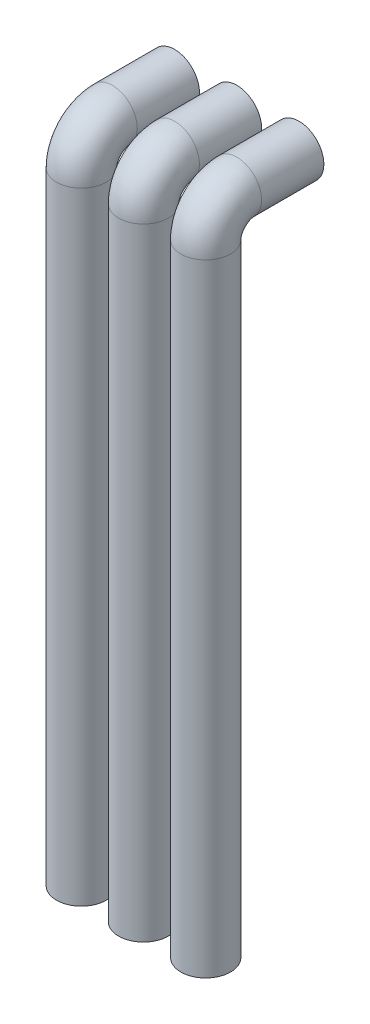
ISO-10303-21;
HEADER;
FILE_DESCRIPTION(('STEP AP214'),'2;1');
FILE_NAME('part.step','',(''),(''),'','','');
FILE_SCHEMA(('AUTOMOTIVE_DESIGN { 1 0 10303 214 1 1 1 1 }'));
ENDSEC;
DATA;
#1=APPLICATION_CONTEXT('core data for automotive mechanical design processes');
#2=APPLICATION_PROTOCOL_DEFINITION('international standard','automotive_design',2000,#1);
#3=PRODUCT_CONTEXT('',#1,'mechanical');
#4=PRODUCT('Part','Part','',(#3));
#5=PRODUCT_RELATED_PRODUCT_CATEGORY('part','',(#4));
#6=PRODUCT_DEFINITION_FORMATION('','',#4);
#7=PRODUCT_DEFINITION_CONTEXT('part definition',#1,'design');
#8=PRODUCT_DEFINITION('design','',#6,#7);
#9=PRODUCT_DEFINITION_SHAPE('','',#8);
#10=(LENGTH_UNIT() NAMED_UNIT(*) SI_UNIT(.MILLI.,.METRE.));
#11=(NAMED_UNIT(*) PLANE_ANGLE_UNIT() SI_UNIT($,.RADIAN.));
#12=(NAMED_UNIT(*) SI_UNIT($,.STERADIAN.) SOLID_ANGLE_UNIT());
#13=UNCERTAINTY_MEASURE_WITH_UNIT(LENGTH_MEASURE(1.E-05),#10,'distance_accuracy_value','');
#14=(GEOMETRIC_REPRESENTATION_CONTEXT(3) GLOBAL_UNCERTAINTY_ASSIGNED_CONTEXT((#13)) GLOBAL_UNIT_ASSIGNED_CONTEXT((#10,
#11,#12)) REPRESENTATION_CONTEXT('',''));
#15=CARTESIAN_POINT('',(0.,0.,0.));
#16=DIRECTION('',(0.,0.,1.));
#17=DIRECTION('',(1.,0.,0.));
#18=AXIS2_PLACEMENT_3D('',#15,#16,#17);
#19=CARTESIAN_POINT('',(-31.3087189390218,10.,-2.5881473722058));
#20=DIRECTION('',(0.,-1.,0.));
#21=DIRECTION('',(0.,0.,-1.));
#22=AXIS2_PLACEMENT_3D('',#19,#20,#21);
#23=CYLINDRICAL_SURFACE('',#22,0.400000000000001);
#24=CARTESIAN_POINT('',(-31.3087189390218,10.,-2.5881473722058));
#25=DIRECTION('',(0.,1.,0.));
#26=DIRECTION('',(0.,0.,1.));
#27=AXIS2_PLACEMENT_3D('',#24,#25,#26);
#28=CIRCLE('',#27,0.400000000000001);
#29=CARTESIAN_POINT('',(-31.3087189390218,10.,-2.1881473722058));
#30=VERTEX_POINT('',#29);
#31=EDGE_CURVE('E12',#30,#30,#28,.T.);
#32=ORIENTED_EDGE('',*,*,#31,.F.);
#33=EDGE_LOOP('',(#32));
#34=FACE_BOUND('',#33,.T.);
#35=CARTESIAN_POINT('',(-31.3087189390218,0.,-2.5881473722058));
#36=DIRECTION('',(0.,1.,0.));
#37=DIRECTION('',(0.,0.,1.));
#38=AXIS2_PLACEMENT_3D('',#35,#36,#37);
#39=CIRCLE('',#38,0.400000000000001);
#40=CARTESIAN_POINT('',(-31.3087189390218,0.,-2.1881473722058));
#41=VERTEX_POINT('',#40);
#42=EDGE_CURVE('E60',#41,#41,#39,.T.);
#43=ORIENTED_EDGE('',*,*,#42,.T.);
#44=EDGE_LOOP('',(#43));
#45=FACE_BOUND('',#44,.T.);
#46=ADVANCED_FACE('F57',(#34,#45),#23,.T.);
#47=CARTESIAN_POINT('',(-31.3087189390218,0.,-2.5881473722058));
#48=DIRECTION('',(0.,1.,0.));
#49=DIRECTION('',(0.,0.,1.));
#50=AXIS2_PLACEMENT_3D('',#47,#48,#49);
#51=PLANE('',#50);
#52=ORIENTED_EDGE('',*,*,#42,.F.);
#53=EDGE_LOOP('',(#52));
#54=FACE_BOUND('',#53,.T.);
#55=ADVANCED_FACE('F87',(#54),#51,.F.);
#56=CARTESIAN_POINT('',(-31.3087189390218,10.5,-4.0881473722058));
#57=DIRECTION('',(0.,-0.000968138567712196,-0.999999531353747));
#58=DIRECTION('',(0.,0.999999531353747,-0.000968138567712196));
#59=AXIS2_PLACEMENT_3D('',#56,#57,#58);
#60=PLANE('',#59);
#61=CARTESIAN_POINT('',(-31.3087189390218,10.5,-4.0881473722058));
#62=DIRECTION('',(0.,-0.000968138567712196,-0.999999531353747));
#63=DIRECTION('',(0.,0.999999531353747,-0.000968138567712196));
#64=AXIS2_PLACEMENT_3D('',#61,#62,#63);
#65=CIRCLE('',#64,0.400000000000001);
#66=CARTESIAN_POINT('',(-31.3087189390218,10.8999998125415,-4.08853462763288));
#67=VERTEX_POINT('',#66);
#68=EDGE_CURVE('E71',#67,#67,#65,.T.);
#69=ORIENTED_EDGE('',*,*,#68,.T.);
#70=EDGE_LOOP('',(#69));
#71=FACE_BOUND('',#70,.T.);
#72=ADVANCED_FACE('F75',(#71),#60,.T.);
#73=CARTESIAN_POINT('',(-31.3087189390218,10.8999998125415,-4.08853462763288));
#74=CARTESIAN_POINT('',(-31.3087189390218,10.8999998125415,-3.0880507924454));
#75=CARTESIAN_POINT('',(-30.5087189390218,10.8999998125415,-4.08853462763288));
#76=CARTESIAN_POINT('',(-30.5087189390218,10.8999998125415,-3.0880507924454));
#77=CARTESIAN_POINT('',(-30.5087189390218,10.1000001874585,-4.08776011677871));
#78=CARTESIAN_POINT('',(-30.5087189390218,10.1000001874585,-3.08727628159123));
#79=CARTESIAN_POINT('',(-31.3087189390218,10.1000001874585,-4.08776011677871));
#80=CARTESIAN_POINT('',(-31.3087189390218,10.1000001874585,-3.08727628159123));
#81=CARTESIAN_POINT('',(-32.1087189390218,10.1000001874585,-4.08776011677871));
#82=CARTESIAN_POINT('',(-32.1087189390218,10.1000001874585,-3.08727628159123));
#83=CARTESIAN_POINT('',(-32.1087189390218,10.8999998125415,-4.08853462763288));
#84=CARTESIAN_POINT('',(-32.1087189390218,10.8999998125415,-3.0880507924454));
#85=CARTESIAN_POINT('',(-31.3087189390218,10.8999998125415,-4.08853462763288));
#86=CARTESIAN_POINT('',(-31.3087189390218,10.8999998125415,-3.0880507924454));
#87=(BOUNDED_SURFACE() B_SPLINE_SURFACE(3,1,((#73,#74),(#75,#76),(#77,#78),(#79,#80),(#81,#82),
(#83,#84),(#85,#86)),.UNSPECIFIED.,.T.,.F.,.F.) B_SPLINE_SURFACE_WITH_KNOTS((4,3,4),(2,2),(0.,
0.5,1.),(0.,1.),.UNSPECIFIED.) GEOMETRIC_REPRESENTATION_ITEM() RATIONAL_B_SPLINE_SURFACE(((1.,
1.),(0.333333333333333,0.333333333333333),(0.333333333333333,0.333333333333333),(1.,1.),
(0.333333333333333,0.333333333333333),(0.333333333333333,0.333333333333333),(1.,1.))) REPRESENTATION_ITEM('') SURFACE());
#88=CARTESIAN_POINT('',(-31.3087189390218,10.5,-3.08766353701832));
#89=DIRECTION('',(0.,-0.000968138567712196,-0.999999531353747));
#90=DIRECTION('',(0.,0.999999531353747,-0.000968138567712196));
#91=AXIS2_PLACEMENT_3D('',#88,#89,#90);
#92=CIRCLE('',#91,0.400000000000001);
#93=CARTESIAN_POINT('',(-31.3087189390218,10.8999998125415,-3.0880507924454));
#94=VERTEX_POINT('',#93);
#95=EDGE_CURVE('E67',#94,#94,#92,.T.);
#96=CARTESIAN_POINT('',(-31.3087189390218,10.8999998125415,-3.0880507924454));
#97=CARTESIAN_POINT('',(-31.3087189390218,10.8999998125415,-3.09847249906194));
#98=CARTESIAN_POINT('',(-31.3087189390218,10.8999998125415,-3.10889420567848));
#99=CARTESIAN_POINT('',(-31.3087189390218,10.8999998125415,-3.12973761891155));
#100=CARTESIAN_POINT('',(-31.3087189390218,10.8999998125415,-3.14015932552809));
#101=CARTESIAN_POINT('',(-31.3087189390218,10.8999998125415,-3.16100273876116));
#102=CARTESIAN_POINT('',(-31.3087189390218,10.8999998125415,-3.17142444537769));
#103=CARTESIAN_POINT('',(-31.3087189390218,10.8999998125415,-3.19226785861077));
#104=CARTESIAN_POINT('',(-31.3087189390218,10.8999998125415,-3.2026895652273));
#105=CARTESIAN_POINT('',(-31.3087189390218,10.8999998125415,-3.22353297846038));
#106=CARTESIAN_POINT('',(-31.3087189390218,10.8999998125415,-3.23395468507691));
#107=CARTESIAN_POINT('',(-31.3087189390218,10.8999998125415,-3.25479809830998));
#108=CARTESIAN_POINT('',(-31.3087189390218,10.8999998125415,-3.26521980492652));
#109=CARTESIAN_POINT('',(-31.3087189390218,10.8999998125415,-3.28606321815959));
#110=CARTESIAN_POINT('',(-31.3087189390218,10.8999998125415,-3.29648492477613));
#111=CARTESIAN_POINT('',(-31.3087189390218,10.8999998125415,-3.3173283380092));
#112=CARTESIAN_POINT('',(-31.3087189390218,10.8999998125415,-3.32775004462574));
#113=CARTESIAN_POINT('',(-31.3087189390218,10.8999998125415,-3.34859345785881));
#114=CARTESIAN_POINT('',(-31.3087189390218,10.8999998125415,-3.35901516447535));
#115=CARTESIAN_POINT('',(-31.3087189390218,10.8999998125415,-3.37985857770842));
#116=CARTESIAN_POINT('',(-31.3087189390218,10.8999998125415,-3.39028028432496));
#117=CARTESIAN_POINT('',(-31.3087189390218,10.8999998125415,-3.41112369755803));
#118=CARTESIAN_POINT('',(-31.3087189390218,10.8999998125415,-3.42154540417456));
#119=CARTESIAN_POINT('',(-31.3087189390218,10.8999998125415,-3.44238881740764));
#120=CARTESIAN_POINT('',(-31.3087189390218,10.8999998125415,-3.45281052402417));
#121=CARTESIAN_POINT('',(-31.3087189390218,10.8999998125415,-3.47365393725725));
#122=CARTESIAN_POINT('',(-31.3087189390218,10.8999998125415,-3.48407564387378));
#123=CARTESIAN_POINT('',(-31.3087189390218,10.8999998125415,-3.50491905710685));
#124=CARTESIAN_POINT('',(-31.3087189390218,10.8999998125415,-3.51534076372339));
#125=CARTESIAN_POINT('',(-31.3087189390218,10.8999998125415,-3.53618417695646));
#126=CARTESIAN_POINT('',(-31.3087189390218,10.8999998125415,-3.546605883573));
#127=CARTESIAN_POINT('',(-31.3087189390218,10.8999998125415,-3.56744929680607));
#128=CARTESIAN_POINT('',(-31.3087189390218,10.8999998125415,-3.57787100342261));
#129=CARTESIAN_POINT('',(-31.3087189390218,10.8999998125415,-3.59871441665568));
#130=CARTESIAN_POINT('',(-31.3087189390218,10.8999998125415,-3.60913612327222));
#131=CARTESIAN_POINT('',(-31.3087189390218,10.8999998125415,-3.62997953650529));
#132=CARTESIAN_POINT('',(-31.3087189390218,10.8999998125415,-3.64040124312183));
#133=CARTESIAN_POINT('',(-31.3087189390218,10.8999998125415,-3.6612446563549));
#134=CARTESIAN_POINT('',(-31.3087189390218,10.8999998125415,-3.67166636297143));
#135=CARTESIAN_POINT('',(-31.3087189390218,10.8999998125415,-3.69250977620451));
#136=CARTESIAN_POINT('',(-31.3087189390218,10.8999998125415,-3.70293148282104));
#137=CARTESIAN_POINT('',(-31.3087189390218,10.8999998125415,-3.72377489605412));
#138=CARTESIAN_POINT('',(-31.3087189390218,10.8999998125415,-3.73419660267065));
#139=CARTESIAN_POINT('',(-31.3087189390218,10.8999998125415,-3.75504001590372));
#140=CARTESIAN_POINT('',(-31.3087189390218,10.8999998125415,-3.76546172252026));
#141=CARTESIAN_POINT('',(-31.3087189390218,10.8999998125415,-3.78630513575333));
#142=CARTESIAN_POINT('',(-31.3087189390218,10.8999998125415,-3.79672684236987));
#143=CARTESIAN_POINT('',(-31.3087189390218,10.8999998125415,-3.81757025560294));
#144=CARTESIAN_POINT('',(-31.3087189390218,10.8999998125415,-3.82799196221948));
#145=CARTESIAN_POINT('',(-31.3087189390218,10.8999998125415,-3.84883537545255));
#146=CARTESIAN_POINT('',(-31.3087189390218,10.8999998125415,-3.85925708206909));
#147=CARTESIAN_POINT('',(-31.3087189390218,10.8999998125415,-3.88010049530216));
#148=CARTESIAN_POINT('',(-31.3087189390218,10.8999998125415,-3.8905222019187));
#149=CARTESIAN_POINT('',(-31.3087189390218,10.8999998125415,-3.91136561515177));
#150=CARTESIAN_POINT('',(-31.3087189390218,10.8999998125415,-3.9217873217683));
#151=CARTESIAN_POINT('',(-31.3087189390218,10.8999998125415,-3.94263073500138));
#152=CARTESIAN_POINT('',(-31.3087189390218,10.8999998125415,-3.95305244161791));
#153=CARTESIAN_POINT('',(-31.3087189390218,10.8999998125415,-3.97389585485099));
#154=CARTESIAN_POINT('',(-31.3087189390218,10.8999998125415,-3.98431756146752));
#155=CARTESIAN_POINT('',(-31.3087189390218,10.8999998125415,-4.00516097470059));
#156=CARTESIAN_POINT('',(-31.3087189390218,10.8999998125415,-4.01558268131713));
#157=CARTESIAN_POINT('',(-31.3087189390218,10.8999998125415,-4.0364260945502));
#158=CARTESIAN_POINT('',(-31.3087189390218,10.8999998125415,-4.04684780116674));
#159=CARTESIAN_POINT('',(-31.3087189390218,10.8999998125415,-4.06769121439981));
#160=CARTESIAN_POINT('',(-31.3087189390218,10.8999998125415,-4.07811292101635));
#161=CARTESIAN_POINT('',(-31.3087189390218,10.8999998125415,-4.08853462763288));
#162=B_SPLINE_CURVE_WITH_KNOTS('',3,(#96,#97,#98,#99,#100,#101,#102,#103,#104,#105,#106,#107,
#108,#109,#110,#111,#112,#113,#114,#115,#116,#117,#118,#119,#120,#121,#122,#123,#124,#125,#126,
#127,#128,#129,#130,#131,#132,#133,#134,#135,#136,#137,#138,#139,#140,#141,#142,#143,#144,#145,
#146,#147,#148,#149,#150,#151,#152,#153,#154,#155,#156,#157,#158,#159,#160,#161),.UNSPECIFIED.,
.F.,.F.,(4,2,2,2,2,2,2,2,2,2,2,2,2,2,2,2,2,2,2,2,2,2,2,2,2,2,2,2,2,2,2,2,4),(0.,
0.0312651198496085,0.0625302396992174,0.0937953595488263,0.125060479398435,0.156325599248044,
0.187590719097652,0.218855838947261,0.25012095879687,0.281386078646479,0.312651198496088,
0.343916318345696,0.375181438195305,0.406446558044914,0.437711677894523,0.468976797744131,
0.50024191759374,0.531507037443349,0.562772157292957,0.594037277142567,0.625302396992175,
0.656567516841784,0.687832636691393,0.719097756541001,0.75036287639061,0.781627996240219,
0.812893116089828,0.844158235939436,0.875423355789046,0.906688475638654,0.937953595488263,
0.969218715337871,1.00048383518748),.UNSPECIFIED.);
#163=EDGE_CURVE('BSEAM77',#94,#67,#162,.T.);
#164=ORIENTED_EDGE('',*,*,#95,.T.);
#165=ORIENTED_EDGE('',*,*,#68,.F.);
#166=ORIENTED_EDGE('',*,*,#163,.T.);
#167=ORIENTED_EDGE('',*,*,#163,.F.);
#168=EDGE_LOOP('',(#164,#166,#165,#167));
#169=FACE_BOUND('',#168,.T.);
#170=ADVANCED_FACE('F77',(#169),#87,.F.);
#171=CARTESIAN_POINT('',(-31.3087189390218,10.8999998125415,-3.0880507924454));
#172=CARTESIAN_POINT('',(-31.3087189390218,10.9002268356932,-2.56072182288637));
#173=CARTESIAN_POINT('',(-31.3087189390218,10.5273289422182,-2.18786386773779));
#174=CARTESIAN_POINT('',(-31.3087189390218,10.,-2.1881473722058));
#175=CARTESIAN_POINT('',(-30.5087189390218,10.8999998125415,-3.0880507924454));
#176=CARTESIAN_POINT('',(-30.5087189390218,10.9002268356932,-2.56072182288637));
#177=CARTESIAN_POINT('',(-30.5087189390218,10.5273289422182,-2.18786386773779));
#178=CARTESIAN_POINT('',(-30.5087189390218,10.,-2.1881473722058));
#179=CARTESIAN_POINT('',(-30.5087189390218,10.1000001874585,-3.08727628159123));
#180=CARTESIAN_POINT('',(-30.5087189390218,10.0997731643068,-3.0289360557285));
#181=CARTESIAN_POINT('',(-30.5087189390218,10.0583399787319,-2.98786386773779));
#182=CARTESIAN_POINT('',(-30.5087189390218,10.,-2.9881473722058));
#183=CARTESIAN_POINT('',(-31.3087189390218,10.1000001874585,-3.08727628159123));
#184=CARTESIAN_POINT('',(-31.3087189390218,10.0997731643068,-3.0289360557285));
#185=CARTESIAN_POINT('',(-31.3087189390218,10.0583399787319,-2.9878638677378));
#186=CARTESIAN_POINT('',(-31.3087189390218,10.,-2.9881473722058));
#187=CARTESIAN_POINT('',(-32.1087189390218,10.1000001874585,-3.08727628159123));
#188=CARTESIAN_POINT('',(-32.1087189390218,10.0997731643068,-3.0289360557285));
#189=CARTESIAN_POINT('',(-32.1087189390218,10.0583399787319,-2.98786386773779));
#190=CARTESIAN_POINT('',(-32.1087189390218,10.,-2.9881473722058));
#191=CARTESIAN_POINT('',(-32.1087189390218,10.8999998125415,-3.0880507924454));
#192=CARTESIAN_POINT('',(-32.1087189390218,10.9002268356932,-2.56072182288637));
#193=CARTESIAN_POINT('',(-32.1087189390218,10.5273289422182,-2.18786386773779));
#194=CARTESIAN_POINT('',(-32.1087189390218,10.,-2.1881473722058));
#195=CARTESIAN_POINT('',(-31.3087189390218,10.8999998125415,-3.0880507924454));
#196=CARTESIAN_POINT('',(-31.3087189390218,10.9002268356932,-2.56072182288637));
#197=CARTESIAN_POINT('',(-31.3087189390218,10.5273289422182,-2.18786386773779));
#198=CARTESIAN_POINT('',(-31.3087189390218,10.,-2.1881473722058));
#199=(BOUNDED_SURFACE() B_SPLINE_SURFACE(3,3,((#171,#172,#173,#174),(#175,#176,#177,#178),(#179,
#180,#181,#182),(#183,#184,#185,#186),(#187,#188,#189,#190),(#191,#192,#193,#194),(#195,#196,
#197,#198)),.UNSPECIFIED.,.T.,.F.,.F.) B_SPLINE_SURFACE_WITH_KNOTS((4,3,4),(4,4),(0.,0.5,1.),
(0.,1.),.UNSPECIFIED.) GEOMETRIC_REPRESENTATION_ITEM() RATIONAL_B_SPLINE_SURFACE(((1.,
0.80450960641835,0.80450960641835,1.),(0.333333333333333,0.268169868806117,0.268169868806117,
0.333333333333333),(0.333333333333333,0.268169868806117,0.268169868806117,0.333333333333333),
(1.,0.80450960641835,0.80450960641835,1.),(0.333333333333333,0.268169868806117,
0.268169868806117,0.333333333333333),(0.333333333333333,0.268169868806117,0.268169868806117,
0.333333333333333),(1.,0.80450960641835,0.80450960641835,1.))) REPRESENTATION_ITEM('') SURFACE());
#200=CARTESIAN_POINT('',(-31.3087189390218,10.,-2.1881473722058));
#201=CARTESIAN_POINT('',(-31.3087189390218,10.0033219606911,-2.18814558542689));
#202=CARTESIAN_POINT('',(-31.3087189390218,10.0066439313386,-2.18816220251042));
#203=CARTESIAN_POINT('',(-31.3087189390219,10.0133025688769,-2.18823239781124));
#204=CARTESIAN_POINT('',(-31.3087189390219,10.0166392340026,-2.1882861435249));
#205=CARTESIAN_POINT('',(-31.3087189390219,10.023326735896,-2.18843109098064));
#206=CARTESIAN_POINT('',(-31.3087189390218,10.0266775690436,-2.18852245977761));
#207=CARTESIAN_POINT('',(-31.3087189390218,10.0333928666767,-2.18874313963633));
#208=CARTESIAN_POINT('',(-31.3087189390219,10.0367573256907,-2.18887261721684));
#209=CARTESIAN_POINT('',(-31.3087189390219,10.0434993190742,-2.18916999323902));
#210=CARTESIAN_POINT('',(-31.3087189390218,10.0468768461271,-2.18933805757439));
#211=CARTESIAN_POINT('',(-31.3087189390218,10.0536444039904,-2.18971307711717));
#212=CARTESIAN_POINT('',(-31.3087189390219,10.0570344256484,-2.18992019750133));
#213=CARTESIAN_POINT('',(-31.3087189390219,10.0638263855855,-2.19037379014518));
#214=CARTESIAN_POINT('',(-31.3087189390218,10.0672283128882,-2.19062042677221));
#215=CARTESIAN_POINT('',(-31.3087189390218,10.0740434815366,-2.19115350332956));
#216=CARTESIAN_POINT('',(-31.3087189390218,10.0774567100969,-2.19144010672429));
#217=CARTESIAN_POINT('',(-31.3087189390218,10.084293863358,-2.19205355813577));
#218=CARTESIAN_POINT('',(-31.3087189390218,10.0877177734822,-2.19238056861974));
#219=CARTESIAN_POINT('',(-31.3087189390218,10.0945756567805,-2.19307526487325));
#220=CARTESIAN_POINT('',(-31.3087189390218,10.0980096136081,-2.19344311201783));
#221=CARTESIAN_POINT('',(-31.3087189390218,10.1048869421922,-2.19421990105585));
#222=CARTESIAN_POINT('',(-31.3087189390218,10.1083302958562,-2.19462900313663));
#223=CARTESIAN_POINT('',(-31.3087189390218,10.1152257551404,-2.19548870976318));
#224=CARTESIAN_POINT('',(-31.3087189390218,10.1186778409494,-2.19593947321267));
#225=CARTESIAN_POINT('',(-31.3087189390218,10.1255900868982,-2.1968828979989));
#226=CARTESIAN_POINT('',(-31.3087189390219,10.1290502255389,-2.19737571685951));
#227=CARTESIAN_POINT('',(-31.3087189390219,10.1359778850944,-2.19840363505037));
#228=CARTESIAN_POINT('',(-31.3087189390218,10.1394453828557,-2.1989388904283));
#229=CARTESIAN_POINT('',(-31.3087189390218,10.1463870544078,-2.20005205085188));
#230=CARTESIAN_POINT('',(-31.3087189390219,10.1498612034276,-2.20063011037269));
#231=CARTESIAN_POINT('',(-31.3087189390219,10.1568154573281,-2.20182923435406));
#232=CARTESIAN_POINT('',(-31.3087189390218,10.1602955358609,-2.20245045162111));
#233=CARTESIAN_POINT('',(-31.3087189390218,10.1672609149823,-2.20373623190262));
#234=CARTESIAN_POINT('',(-31.3087189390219,10.1707461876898,-2.20440094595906));
#235=CARTESIAN_POINT('',(-31.3087189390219,10.1777212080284,-2.20577404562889));
#236=CARTESIAN_POINT('',(-31.3087189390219,10.181210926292,-2.20648258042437));
#237=CARTESIAN_POINT('',(-31.3087189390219,10.1881940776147,-2.20794363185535));
#238=CARTESIAN_POINT('',(-31.3087189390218,10.1916874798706,-2.20869629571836));
#239=CARTESIAN_POINT('',(-31.3087189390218,10.1986772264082,-2.21024589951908));
#240=CARTESIAN_POINT('',(-31.3087189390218,10.2021735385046,-2.21104298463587));
#241=CARTESIAN_POINT('',(-31.3087189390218,10.2091683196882,-2.21268170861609));
#242=CARTESIAN_POINT('',(-31.3087189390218,10.2126667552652,-2.21352349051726));
#243=CARTESIAN_POINT('',(-31.3087189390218,10.2196649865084,-2.21525186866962));
#244=CARTESIAN_POINT('',(-31.3087189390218,10.2231647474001,-2.21613860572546));
#245=CARTESIAN_POINT('',(-31.3087189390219,10.2301648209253,-2.21795713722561));
#246=CARTESIAN_POINT('',(-31.3087189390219,10.2336650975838,-2.21888907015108));
#247=CARTESIAN_POINT('',(-31.3087189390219,10.2406653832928,-2.22079821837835));
#248=CARTESIAN_POINT('',(-31.3087189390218,10.2441653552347,-2.22177556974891));
#249=CARTESIAN_POINT('',(-31.3087189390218,10.2511642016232,-2.22377576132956));
#250=CARTESIAN_POINT('',(-31.3087189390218,10.2546630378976,-2.22479873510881));
#251=CARTESIAN_POINT('',(-31.3087189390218,10.2616587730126,-2.22689035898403));
#252=CARTESIAN_POINT('',(-31.3087189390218,10.2651556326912,-2.22795914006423));
#253=CARTESIAN_POINT('',(-31.3087189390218,10.272146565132,-2.23014254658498));
#254=CARTESIAN_POINT('',(-31.3087189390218,10.275640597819,-2.23125730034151));
#255=CARTESIAN_POINT('',(-31.3087189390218,10.2826250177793,-2.23353280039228));
#256=CARTESIAN_POINT('',(-31.3087189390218,10.2861153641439,-2.23469367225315));
#257=CARTESIAN_POINT('',(-31.3087189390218,10.2930915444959,-2.23706153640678));
#258=CARTESIAN_POINT('',(-31.3087189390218,10.2965773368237,-2.23826865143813));
#259=CARTESIAN_POINT('',(-31.3087189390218,10.3035435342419,-2.24072910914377));
#260=CARTESIAN_POINT('',(-31.3087189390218,10.3070238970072,-2.24198257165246));
#261=CARTESIAN_POINT('',(-31.3087189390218,10.3139783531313,-2.24453581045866));
#262=CARTESIAN_POINT('',(-31.3087189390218,10.3174524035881,-2.24583570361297));
#263=CARTESIAN_POINT('',(-31.3087189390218,10.3243933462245,-2.24848186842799));
#264=CARTESIAN_POINT('',(-31.3087189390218,10.3278601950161,-2.24982825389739));
#265=CARTESIAN_POINT('',(-31.3087189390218,10.3347858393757,-2.2525674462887));
#266=CARTESIAN_POINT('',(-31.3087189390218,10.3382445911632,-2.25396036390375));
#267=CARTESIAN_POINT('',(-31.3087189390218,10.3451531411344,-2.25679264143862));
#268=CARTESIAN_POINT('',(-31.3087189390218,10.3486028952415,-2.25823210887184));
#269=CARTESIAN_POINT('',(-31.3087189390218,10.3554925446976,-2.261157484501));
#270=CARTESIAN_POINT('',(-31.3087189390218,10.3589323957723,-2.26264349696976));
#271=CARTESIAN_POINT('',(-31.3087189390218,10.3658013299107,-2.2656619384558));
#272=CARTESIAN_POINT('',(-31.3087189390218,10.3692303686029,-2.26719446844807));
#273=CARTESIAN_POINT('',(-31.3087189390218,10.376076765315,-2.27030589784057));
#274=CARTESIAN_POINT('',(-31.3087189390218,10.3794940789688,-2.27188489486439));
#275=CARTESIAN_POINT('',(-31.3087189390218,10.386316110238,-2.27508918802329));
#276=CARTESIAN_POINT('',(-31.3087189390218,10.3897207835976,-2.27671457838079));
#277=CARTESIAN_POINT('',(-31.3087189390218,10.3965166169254,-2.28001156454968));
#278=CARTESIAN_POINT('',(-31.3087189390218,10.3999077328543,-2.28168325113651));
#279=CARTESIAN_POINT('',(-31.3087189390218,10.4066755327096,-2.28507271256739));
#280=CARTESIAN_POINT('',(-31.3087189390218,10.4100521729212,-2.28679057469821));
#281=CARTESIAN_POINT('',(-31.3087189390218,10.4167901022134,-2.29027224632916));
#282=CARTESIAN_POINT('',(-31.3087189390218,10.4201513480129,-2.29203613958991));
#283=CARTESIAN_POINT('',(-31.3087189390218,10.4268575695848,-2.295609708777));
#284=CARTESIAN_POINT('',(-31.3087189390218,10.4302025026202,-2.29741946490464));
#285=CARTESIAN_POINT('',(-31.3087189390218,10.4368751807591,-2.30108457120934));
#286=CARTESIAN_POINT('',(-31.3087189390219,10.4402028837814,-2.30293999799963));
#287=CARTESIAN_POINT('',(-31.3087189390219,10.4468401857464,-2.30669623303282));
#288=CARTESIAN_POINT('',(-31.3087189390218,10.450149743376,-2.30859711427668));
#289=CARTESIAN_POINT('',(-31.3087189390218,10.456749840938,-2.31244402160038));
#290=CARTESIAN_POINT('',(-31.3087189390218,10.4600403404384,-2.31439011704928));
#291=CARTESIAN_POINT('',(-31.3087189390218,10.4666014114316,-2.31832719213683));
#292=CARTESIAN_POINT('',(-31.3087189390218,10.4698719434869,-2.32031823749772));
#293=CARTESIAN_POINT('',(-31.3087189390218,10.4763921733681,-2.32434492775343));
#294=CARTESIAN_POINT('',(-31.3087189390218,10.4796418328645,-2.32638063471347));
#295=CARTESIAN_POINT('',(-31.3087189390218,10.4861194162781,-2.33049633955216));
#296=CARTESIAN_POINT('',(-31.3087189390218,10.4893473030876,-2.33257639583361));
#297=CARTESIAN_POINT('',(-31.3087189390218,10.4957804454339,-2.33678046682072));
#298=CARTESIAN_POINT('',(-31.3087189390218,10.4989856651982,-2.3389045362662));
#299=CARTESIAN_POINT('',(-31.3087189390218,10.5053725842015,-2.34319627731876));
#300=CARTESIAN_POINT('',(-31.3087189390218,10.5085542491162,-2.34536400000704));
#301=CARTESIAN_POINT('',(-31.3087189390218,10.514893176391,-2.34974266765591));
#302=CARTESIAN_POINT('',(-31.3087189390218,10.5180504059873,-2.35195366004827));
#303=CARTESIAN_POINT('',(-31.3087189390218,10.5243395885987,-2.3564184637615));
#304=CARTESIAN_POINT('',(-31.3087189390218,10.5274715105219,-2.35867231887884));
#305=CARTESIAN_POINT('',(-31.3087189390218,10.5337092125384,-2.36322242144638));
#306=CARTESIAN_POINT('',(-31.3087189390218,10.5368149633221,-2.36551870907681));
#307=CARTESIAN_POINT('',(-31.3087189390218,10.5429994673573,-2.37015322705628));
#308=CARTESIAN_POINT('',(-31.3087189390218,10.5460781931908,-2.37249149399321));
#309=CARTESIAN_POINT('',(-31.3087189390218,10.552207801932,-2.37720949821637));
#310=CARTESIAN_POINT('',(-31.3087189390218,10.5552586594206,-2.37958926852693));
#311=CARTESIAN_POINT('',(-31.3087189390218,10.5613316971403,-2.38438978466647));
#312=CARTESIAN_POINT('',(-31.3087189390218,10.5643538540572,-2.38681055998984));
#313=CARTESIAN_POINT('',(-31.3087189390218,10.5703686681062,-2.39169256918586));
#314=CARTESIAN_POINT('',(-31.3087189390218,10.5733613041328,-2.39415382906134));
#315=CARTESIAN_POINT('',(-31.3087189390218,10.5793162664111,-2.39911626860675));
#316=CARTESIAN_POINT('',(-31.3087189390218,10.5822785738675,-2.40161747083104));
#317=CARTESIAN_POINT('',(-31.3087189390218,10.5881720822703,-2.40665923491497));
#318=CARTESIAN_POINT('',(-31.3087189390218,10.5911032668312,-2.40919981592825));
#319=CARTESIAN_POINT('',(-31.3087189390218,10.5969337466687,-2.41431975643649));
#320=CARTESIAN_POINT('',(-31.3087189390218,10.5998330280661,-2.41689913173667));
#321=CARTESIAN_POINT('',(-31.3087189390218,10.6055989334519,-2.42209605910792));
#322=CARTESIAN_POINT('',(-31.3087189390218,10.6084655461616,-2.42471362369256));
#323=CARTESIAN_POINT('',(-31.3087189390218,10.6141653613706,-2.42998630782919));
#324=CARTESIAN_POINT('',(-31.3087189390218,10.6169985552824,-2.43264143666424));
#325=CARTESIAN_POINT('',(-31.3087189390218,10.622630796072,-2.43798860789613));
#326=CARTESIAN_POINT('',(-31.3087189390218,10.6254298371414,-2.44068065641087));
#327=CARTESIAN_POINT('',(-31.3087189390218,10.6309930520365,-2.4461010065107));
#328=CARTESIAN_POINT('',(-31.3087189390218,10.6337572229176,-2.44882931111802));
#329=CARTESIAN_POINT('',(-31.3087189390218,10.639249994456,-2.45432149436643));
#330=CARTESIAN_POINT('',(-31.3087189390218,10.6419785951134,-2.45708537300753));
#331=CARTESIAN_POINT('',(-31.3087189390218,10.6473995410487,-2.46264800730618));
#332=CARTESIAN_POINT('',(-31.3087189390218,10.6500918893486,-2.4654467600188));
#333=CARTESIAN_POINT('',(-31.3087189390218,10.6554396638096,-2.47107842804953));
#334=CARTESIAN_POINT('',(-31.3087189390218,10.6580950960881,-2.47391133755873));
#335=CARTESIAN_POINT('',(-31.3087189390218,10.663368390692,-2.47961058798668));
#336=CARTESIAN_POINT('',(-31.3087189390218,10.6659862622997,-2.48247692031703));
#337=CARTESIAN_POINT('',(-31.3087189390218,10.6711838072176,-2.48824226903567));
#338=CARTESIAN_POINT('',(-31.3087189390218,10.6737634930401,-2.49114127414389));
#339=CARTESIAN_POINT('',(-31.3087189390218,10.6788840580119,-2.49697120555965));
#340=CARTESIAN_POINT('',(-31.3087189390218,10.6814249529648,-2.49990211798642));
#341=CARTESIAN_POINT('',(-31.3087189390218,10.6864673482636,-2.50579508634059));
#342=CARTESIAN_POINT('',(-31.3087189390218,10.6889688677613,-2.50875712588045));
#343=CARTESIAN_POINT('',(-31.3087189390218,10.6939319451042,-2.51471155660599));
#344=CARTESIAN_POINT('',(-31.3087189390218,10.6963935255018,-2.51770392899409));
#345=CARTESIAN_POINT('',(-31.3087189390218,10.7012761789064,-2.52371822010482));
#346=CARTESIAN_POINT('',(-31.3087189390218,10.703697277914,-2.52674011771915));
#347=CARTESIAN_POINT('',(-31.3087189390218,10.7084984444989,-2.53281264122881));
#348=CARTESIAN_POINT('',(-31.3087189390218,10.710878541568,-2.53586324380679));
#349=CARTESIAN_POINT('',(-31.3087189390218,10.7155972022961,-2.5419923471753));
#350=CARTESIAN_POINT('',(-31.3087189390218,10.7179357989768,-2.54507082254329));
#351=CARTESIAN_POINT('',(-31.3087189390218,10.7225709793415,-2.55125483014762));
#352=CARTESIAN_POINT('',(-31.3087189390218,10.7248675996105,-2.55436033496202));
#353=CARTESIAN_POINT('',(-31.3087189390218,10.7294183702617,-2.56059754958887));
#354=CARTESIAN_POINT('',(-31.3087189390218,10.731672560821,-2.56372923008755));
#355=CARTESIAN_POINT('',(-31.3087189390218,10.7361380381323,-2.57001793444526));
#356=CARTESIAN_POINT('',(-31.3087189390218,10.7383493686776,-2.57317492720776));
#357=CARTESIAN_POINT('',(-31.3087189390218,10.7427287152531,-2.57951338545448));
#358=CARTESIAN_POINT('',(-31.3087189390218,10.7448967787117,-2.5826948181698));
#359=CARTESIAN_POINT('',(-31.3087189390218,10.7491892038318,-2.58908127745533));
#360=CARTESIAN_POINT('',(-31.3087189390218,10.7513136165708,-2.59228626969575));
#361=CARTESIAN_POINT('',(-31.3087189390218,10.7555183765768,-2.59871896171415));
#362=CARTESIAN_POINT('',(-31.3087189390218,10.7575987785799,-2.60194662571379));
#363=CARTESIAN_POINT('',(-31.3087189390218,10.761715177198,-2.60842376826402));
#364=CARTESIAN_POINT('',(-31.3087189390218,10.7637512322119,-2.61167320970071));
#365=CARTESIAN_POINT('',(-31.3087189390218,10.7677786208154,-2.61819300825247));
#366=CARTESIAN_POINT('',(-31.3087189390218,10.769770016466,-2.62146332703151));
#367=CARTESIAN_POINT('',(-31.3087189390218,10.7737077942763,-2.62802397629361));
#368=CARTESIAN_POINT('',(-31.3087189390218,10.7756542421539,-2.63131426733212));
#369=CARTESIAN_POINT('',(-31.3087189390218,10.7795018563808,-2.63791395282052));
#370=CARTESIAN_POINT('',(-31.3087189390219,10.7814030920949,-2.64122330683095));
#371=CARTESIAN_POINT('',(-31.3087189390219,10.7851600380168,-2.64786020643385));
#372=CARTESIAN_POINT('',(-31.3087189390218,10.7870158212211,-2.65118771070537));
#373=CARTESIAN_POINT('',(-31.3087189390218,10.7906816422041,-2.65785999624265));
#374=CARTESIAN_POINT('',(-31.3087189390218,10.7924917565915,-2.66120473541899));
#375=CARTESIAN_POINT('',(-31.3087189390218,10.7960660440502,-2.66791057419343));
#376=CARTESIAN_POINT('',(-31.3087189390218,10.7978302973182,-2.67127163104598));
#377=CARTESIAN_POINT('',(-31.3087189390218,10.8013126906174,-2.67800918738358));
#378=CARTESIAN_POINT('',(-31.3087189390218,10.8030309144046,-2.68138564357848));
#379=CARTESIAN_POINT('',(-31.3087189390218,10.8064211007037,-2.68815308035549));
#380=CARTESIAN_POINT('',(-31.3087189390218,10.8080931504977,-2.69154401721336));
#381=CARTESIAN_POINT('',(-31.3087189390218,10.8113908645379,-2.69833949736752));
#382=CARTESIAN_POINT('',(-31.3087189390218,10.8130166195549,-2.70174399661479));
#383=CARTESIAN_POINT('',(-31.3087189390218,10.8162216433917,-2.70856568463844));
#384=CARTESIAN_POINT('',(-31.3087189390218,10.8178010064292,-2.71198282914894));
#385=CARTESIAN_POINT('',(-31.3087189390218,10.8209131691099,-2.71882889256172));
#386=CARTESIAN_POINT('',(-31.3087189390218,10.8224460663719,-2.72225776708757));
#387=CARTESIAN_POINT('',(-31.3087189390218,10.8254652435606,-2.72912637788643));
#388=CARTESIAN_POINT('',(-31.3087189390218,10.8269516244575,-2.73256606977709));
#389=CARTESIAN_POINT('',(-31.3087189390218,10.8298777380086,-2.73945540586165));
#390=CARTESIAN_POINT('',(-31.3087189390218,10.8313175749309,-2.74290500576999));
#391=CARTESIAN_POINT('',(-31.3087189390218,10.8341505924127,-2.74981325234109));
#392=CARTESIAN_POINT('',(-31.3087189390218,10.8355438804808,-2.75327185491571));
#393=CARTESIAN_POINT('',(-31.3087189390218,10.8382838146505,-2.76019720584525));
#394=CARTESIAN_POINT('',(-31.3087189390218,10.8396305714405,-2.76366391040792));
#395=CARTESIAN_POINT('',(-31.3087189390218,10.8422774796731,-2.77060456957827));
#396=CARTESIAN_POINT('',(-31.3087189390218,10.8435777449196,-2.7740784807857));
#397=CARTESIAN_POINT('',(-31.3087189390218,10.8461317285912,-2.78103266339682));
#398=CARTESIAN_POINT('',(-31.3087189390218,10.8473855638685,-2.7845128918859));
#399=CARTESIAN_POINT('',(-31.3087189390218,10.8498467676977,-2.79147882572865));
#400=CARTESIAN_POINT('',(-31.3087189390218,10.8510542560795,-2.79496448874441));
#401=CARTESIAN_POINT('',(-31.3087189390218,10.8534228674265,-2.80194041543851));
#402=CARTESIAN_POINT('',(-31.3087189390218,10.8545841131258,-2.80543063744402));
#403=CARTESIAN_POINT('',(-31.3087189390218,10.856860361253,-2.81241481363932));
#404=CARTESIAN_POINT('',(-31.3087189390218,10.8579754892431,-2.8159087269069));
#405=CARTESIAN_POINT('',(-31.3087189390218,10.8601596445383,-2.82289942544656));
#406=CARTESIAN_POINT('',(-31.3087189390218,10.8612288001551,-2.82639617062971));
#407=CARTESIAN_POINT('',(-31.3087189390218,10.8633211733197,-2.83339168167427));
#408=CARTESIAN_POINT('',(-31.3087189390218,10.8643445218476,-2.8368904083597));
#409=CARTESIAN_POINT('',(-31.3087189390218,10.8663454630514,-2.84388904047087));
#410=CARTESIAN_POINT('',(-31.3087189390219,10.8673231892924,-2.84738890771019));
#411=CARTESIAN_POINT('',(-31.3087189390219,10.8692330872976,-2.85438898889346));
#412=CARTESIAN_POINT('',(-31.3087189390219,10.8701653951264,-2.85788916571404));
#413=CARTESIAN_POINT('',(-31.3087189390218,10.8719846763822,-2.86488904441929));
#414=CARTESIAN_POINT('',(-31.3087189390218,10.8728717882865,-2.86838871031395));
#415=CARTESIAN_POINT('',(-31.3087189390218,10.8746009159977,-2.87538675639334));
#416=CARTESIAN_POINT('',(-31.3087189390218,10.8754430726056,-2.87888510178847));
#417=CARTESIAN_POINT('',(-31.3087189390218,10.8770825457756,-2.88587970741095));
#418=CARTESIAN_POINT('',(-31.3087189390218,10.8778800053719,-2.88937593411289));
#419=CARTESIAN_POINT('',(-31.3087189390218,10.8794303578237,-2.89636551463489));
#420=CARTESIAN_POINT('',(-31.3087189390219,10.8801833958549,-2.89985883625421));
#421=CARTESIAN_POINT('',(-31.3087189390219,10.881645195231,-2.90684183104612));
#422=CARTESIAN_POINT('',(-31.3087189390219,10.8823541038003,-2.91033147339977));
#423=CARTESIAN_POINT('',(-31.3087189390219,10.8837279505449,-2.91730634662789));
#424=CARTESIAN_POINT('',(-31.3087189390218,10.8843930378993,-2.920791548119));
#425=CARTESIAN_POINT('',(-31.3087189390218,10.8856795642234,-2.92775678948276));
#426=CARTESIAN_POINT('',(-31.3087189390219,10.8863011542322,-2.93123680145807));
#427=CARTESIAN_POINT('',(-31.3087189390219,10.8875010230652,-2.93819092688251));
#428=CARTESIAN_POINT('',(-31.3087189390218,10.8880794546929,-2.94166501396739));
#429=CARTESIAN_POINT('',(-31.3087189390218,10.8891933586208,-2.94860656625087));
#430=CARTESIAN_POINT('',(-31.3087189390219,10.8897289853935,-2.95207400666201));
#431=CARTESIAN_POINT('',(-31.3087189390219,10.8907576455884,-2.95900155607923));
#432=CARTESIAN_POINT('',(-31.3087189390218,10.8912508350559,-2.96246164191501));
#433=CARTESIAN_POINT('',(-31.3087189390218,10.8921950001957,-2.96937378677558));
#434=CARTESIAN_POINT('',(-31.3087189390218,10.8926461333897,-2.9728258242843));
#435=CARTESIAN_POINT('',(-31.3087189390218,10.8935065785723,-2.97972119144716));
#436=CARTESIAN_POINT('',(-31.3087189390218,10.8939160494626,-2.98316450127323));
#437=CARTESIAN_POINT('',(-31.3087189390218,10.8946935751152,-2.99004174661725));
#438=CARTESIAN_POINT('',(-31.3087189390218,10.895061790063,-2.99347566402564));
#439=CARTESIAN_POINT('',(-31.3087189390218,10.8957572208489,-3.00033347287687));
#440=CARTESIAN_POINT('',(-31.3087189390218,10.8960845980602,-3.00375734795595));
#441=CARTESIAN_POINT('',(-31.3087189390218,10.8966987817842,-3.01059443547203));
#442=CARTESIAN_POINT('',(-31.3087189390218,10.8969857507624,-3.0140076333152));
#443=CARTESIAN_POINT('',(-31.3087189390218,10.8975195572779,-3.02082274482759));
#444=CARTESIAN_POINT('',(-31.3087189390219,10.8977665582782,-3.02422464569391));
#445=CARTESIAN_POINT('',(-31.3087189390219,10.8982208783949,-3.03101655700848));
#446=CARTESIAN_POINT('',(-31.3087189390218,10.8984283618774,-3.03440655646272));
#447=CARTESIAN_POINT('',(-31.3087189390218,10.8988041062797,-3.04117407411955));
#448=CARTESIAN_POINT('',(-31.3087189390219,10.8989725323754,-3.04455158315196));
#449=CARTESIAN_POINT('',(-31.3087189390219,10.8992706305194,-3.0512935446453));
#450=CARTESIAN_POINT('',(-31.3087189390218,10.8994004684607,-3.05465798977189));
#451=CARTESIAN_POINT('',(-31.3087189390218,10.8996218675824,-3.06137326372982));
#452=CARTESIAN_POINT('',(-31.3087189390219,10.8997135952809,-3.06472408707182));
#453=CARTESIAN_POINT('',(-31.3087189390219,10.8998592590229,-3.07141157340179));
#454=CARTESIAN_POINT('',(-31.3087189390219,10.8999133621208,-3.07474823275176));
#455=CARTESIAN_POINT('',(-31.3087189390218,10.8999842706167,-3.08140686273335));
#456=CARTESIAN_POINT('',(-31.3087189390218,10.9000012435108,-3.084728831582));
#457=CARTESIAN_POINT('',(-31.3087189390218,10.8999998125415,-3.0880507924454));
#458=B_SPLINE_CURVE_WITH_KNOTS('',3,(#200,#201,#202,#203,#204,#205,#206,#207,#208,#209,#210,
#211,#212,#213,#214,#215,#216,#217,#218,#219,#220,#221,#222,#223,#224,#225,#226,#227,#228,#229,
#230,#231,#232,#233,#234,#235,#236,#237,#238,#239,#240,#241,#242,#243,#244,#245,#246,#247,#248,
#249,#250,#251,#252,#253,#254,#255,#256,#257,#258,#259,#260,#261,#262,#263,#264,#265,#266,#267,
#268,#269,#270,#271,#272,#273,#274,#275,#276,#277,#278,#279,#280,#281,#282,#283,#284,#285,#286,
#287,#288,#289,#290,#291,#292,#293,#294,#295,#296,#297,#298,#299,#300,#301,#302,#303,#304,#305,
#306,#307,#308,#309,#310,#311,#312,#313,#314,#315,#316,#317,#318,#319,#320,#321,#322,#323,#324,
#325,#326,#327,#328,#329,#330,#331,#332,#333,#334,#335,#336,#337,#338,#339,#340,#341,#342,#343,
#344,#345,#346,#347,#348,#349,#350,#351,#352,#353,#354,#355,#356,#357,#358,#359,#360,#361,#362,
#363,#364,#365,#366,#367,#368,#369,#370,#371,#372,#373,#374,#375,#376,#377,#378,#379,#380,#381,
#382,#383,#384,#385,#386,#387,#388,#389,#390,#391,#392,#393,#394,#395,#396,#397,#398,#399,#400,
#401,#402,#403,#404,#405,#406,#407,#408,#409,#410,#411,#412,#413,#414,#415,#416,#417,#418,#419,
#420,#421,#422,#423,#424,#425,#426,#427,#428,#429,#430,#431,#432,#433,#434,#435,#436,#437,#438,
#439,#440,#441,#442,#443,#444,#445,#446,#447,#448,#449,#450,#451,#452,#453,#454,#455,#456,#457),
.UNSPECIFIED.,.F.,.F.,(4,2,2,2,2,2,2,2,2,2,2,2,2,2,2,2,2,2,2,2,2,2,2,2,2,2,2,2,2,2,2,2,2,2,2,2,
2,2,2,2,2,2,2,2,2,2,2,2,2,2,2,2,2,2,2,2,2,2,2,2,2,2,2,2,2,2,2,2,2,2,2,2,2,2,2,2,2,2,2,2,2,2,2,2,
2,2,2,2,2,2,2,2,2,2,2,2,2,2,2,2,2,2,2,2,2,2,2,2,2,2,2,2,2,2,2,2,2,2,2,2,2,2,2,2,2,2,2,2,4),(0.,
0.00996583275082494,0.019976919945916,0.0300329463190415,0.0401335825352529,0.0502784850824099,
0.0604672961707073,0.0706996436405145,0.0809751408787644,0.0912933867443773,0.101653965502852,
0.112056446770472,0.122500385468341,0.132985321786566,0.143510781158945,0.154076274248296,
0.164681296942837,0.17532533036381,0.186007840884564,0.196728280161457,0.207486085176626,
0.218280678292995,0.229111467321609,0.239977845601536,0.25087919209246,0.261814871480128,
0.272784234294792,0.283786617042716,0.294821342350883,0.305887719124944,0.316985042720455,
0.328112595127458,0.339269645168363,0.350455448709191,0.361669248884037,0.372910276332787,
0.384177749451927,0.395470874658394,0.406788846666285,0.418130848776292,0.429496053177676,
0.440883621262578,0.452292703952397,0.463722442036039,0.475171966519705,0.486640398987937,
0.498126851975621,0.509630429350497,0.521150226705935,0.532685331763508,0.544234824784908,
0.555797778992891,0.567373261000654,0.578960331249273,0.59055804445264,0.602165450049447,
0.613781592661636,0.62540551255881,0.637036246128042,0.648672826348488,0.66031428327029,
0.671959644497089,0.683607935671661,0.695258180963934,0.706909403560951,0.71856062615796,
0.730210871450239,0.741859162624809,0.753504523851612,0.765145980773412,0.776782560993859,
0.788413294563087,0.800037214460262,0.811653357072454,0.823260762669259,0.834858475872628,
0.846445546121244,0.858021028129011,0.869583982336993,0.881133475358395,0.892668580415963,
0.904188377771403,0.915691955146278,0.927178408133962,0.938646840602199,0.950096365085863,
0.961526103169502,0.97293518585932,0.984322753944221,0.995687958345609,1.00702996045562,
1.0183479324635,1.02964105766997,1.04090853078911,1.05214955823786,1.06336335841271,
1.07454916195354,1.08570621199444,1.09683376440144,1.10793108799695,1.11899746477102,
1.13003219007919,1.14103457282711,1.15200393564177,1.16293961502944,1.17384096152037,
1.18470733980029,1.1955381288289,1.20633272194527,1.21709052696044,1.22781096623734,
1.23849347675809,1.24913751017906,1.25974253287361,1.27030802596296,1.28083348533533,
1.29131842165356,1.30176236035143,1.31216484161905,1.32252542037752,1.33284366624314,
1.34311916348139,1.35335151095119,1.36354032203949,1.37368522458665,1.38378586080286,
1.39384188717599,1.40385297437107,1.4138188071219),.UNSPECIFIED.);
#459=EDGE_CURVE('BSEAM79',#30,#94,#458,.T.);
#460=ORIENTED_EDGE('',*,*,#31,.T.);
#461=ORIENTED_EDGE('',*,*,#95,.F.);
#462=ORIENTED_EDGE('',*,*,#459,.T.);
#463=ORIENTED_EDGE('',*,*,#459,.F.);
#464=EDGE_LOOP('',(#460,#462,#461,#463));
#465=FACE_BOUND('',#464,.T.);
#466=ADVANCED_FACE('F79',(#465),#199,.F.);
#467=CLOSED_SHELL('',(#46,#55,#72,#170,#466));
#468=MANIFOLD_SOLID_BREP('B2',#467);
#469=CARTESIAN_POINT('',(-32.3087189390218,10.,-2.5881473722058));
#470=DIRECTION('',(0.,-1.,0.));
#471=DIRECTION('',(0.,0.,-1.));
#472=AXIS2_PLACEMENT_3D('',#469,#470,#471);
#473=CYLINDRICAL_SURFACE('',#472,0.399999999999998);
#474=CARTESIAN_POINT('',(-32.3087189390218,10.,-2.5881473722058));
#475=DIRECTION('',(0.,1.,0.));
#476=DIRECTION('',(0.,0.,1.));
#477=AXIS2_PLACEMENT_3D('',#474,#475,#476);
#478=CIRCLE('',#477,0.399999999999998);
#479=CARTESIAN_POINT('',(-32.3087189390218,10.,-2.1881473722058));
#480=VERTEX_POINT('',#479);
#481=EDGE_CURVE('E56',#480,#480,#478,.T.);
#482=ORIENTED_EDGE('',*,*,#481,.F.);
#483=EDGE_LOOP('',(#482));
#484=FACE_BOUND('',#483,.T.);
#485=CARTESIAN_POINT('',(-32.3087189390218,0.,-2.5881473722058));
#486=DIRECTION('',(0.,1.,0.));
#487=DIRECTION('',(0.,0.,1.));
#488=AXIS2_PLACEMENT_3D('',#485,#486,#487);
#489=CIRCLE('',#488,0.399999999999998);
#490=CARTESIAN_POINT('',(-32.3087189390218,0.,-2.1881473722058));
#491=VERTEX_POINT('',#490);
#492=EDGE_CURVE('E154',#491,#491,#489,.T.);
#493=ORIENTED_EDGE('',*,*,#492,.T.);
#494=EDGE_LOOP('',(#493));
#495=FACE_BOUND('',#494,.T.);
#496=ADVANCED_FACE('F151',(#484,#495),#473,.T.);
#497=CARTESIAN_POINT('',(-32.3087189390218,0.,-2.5881473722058));
#498=DIRECTION('',(0.,1.,0.));
#499=DIRECTION('',(0.,0.,1.));
#500=AXIS2_PLACEMENT_3D('',#497,#498,#499);
#501=PLANE('',#500);
#502=ORIENTED_EDGE('',*,*,#492,.F.);
#503=EDGE_LOOP('',(#502));
#504=FACE_BOUND('',#503,.T.);
#505=ADVANCED_FACE('F181',(#504),#501,.F.);
#506=CARTESIAN_POINT('',(-32.3087189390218,10.5,-4.0881473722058));
#507=DIRECTION('',(0.,-0.000968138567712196,-0.999999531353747));
#508=DIRECTION('',(0.,0.999999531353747,-0.000968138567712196));
#509=AXIS2_PLACEMENT_3D('',#506,#507,#508);
#510=PLANE('',#509);
#511=CARTESIAN_POINT('',(-32.3087189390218,10.5,-4.0881473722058));
#512=DIRECTION('',(0.,-0.000968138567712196,-0.999999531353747));
#513=DIRECTION('',(0.,0.999999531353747,-0.000968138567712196));
#514=AXIS2_PLACEMENT_3D('',#511,#512,#513);
#515=CIRCLE('',#514,0.399999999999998);
#516=CARTESIAN_POINT('',(-32.3087189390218,10.8999998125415,-4.08853462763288));
#517=VERTEX_POINT('',#516);
#518=EDGE_CURVE('E165',#517,#517,#515,.T.);
#519=ORIENTED_EDGE('',*,*,#518,.T.);
#520=EDGE_LOOP('',(#519));
#521=FACE_BOUND('',#520,.T.);
#522=ADVANCED_FACE('F169',(#521),#510,.T.);
#523=CARTESIAN_POINT('',(-32.3087189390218,10.8999998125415,-4.08853462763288));
#524=CARTESIAN_POINT('',(-32.3087189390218,10.8999998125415,-3.0880507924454));
#525=CARTESIAN_POINT('',(-31.5087189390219,10.8999998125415,-4.08853462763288));
#526=CARTESIAN_POINT('',(-31.5087189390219,10.8999998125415,-3.0880507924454));
#527=CARTESIAN_POINT('',(-31.5087189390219,10.1000001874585,-4.08776011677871));
#528=CARTESIAN_POINT('',(-31.5087189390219,10.1000001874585,-3.08727628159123));
#529=CARTESIAN_POINT('',(-32.3087189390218,10.1000001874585,-4.08776011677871));
#530=CARTESIAN_POINT('',(-32.3087189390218,10.1000001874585,-3.08727628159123));
#531=CARTESIAN_POINT('',(-33.1087189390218,10.1000001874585,-4.08776011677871));
#532=CARTESIAN_POINT('',(-33.1087189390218,10.1000001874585,-3.08727628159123));
#533=CARTESIAN_POINT('',(-33.1087189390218,10.8999998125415,-4.08853462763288));
#534=CARTESIAN_POINT('',(-33.1087189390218,10.8999998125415,-3.0880507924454));
#535=CARTESIAN_POINT('',(-32.3087189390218,10.8999998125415,-4.08853462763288));
#536=CARTESIAN_POINT('',(-32.3087189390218,10.8999998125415,-3.0880507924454));
#537=(BOUNDED_SURFACE() B_SPLINE_SURFACE(3,1,((#523,#524),(#525,#526),(#527,#528),(#529,#530),
(#531,#532),(#533,#534),(#535,#536)),.UNSPECIFIED.,.T.,.F.,.F.) B_SPLINE_SURFACE_WITH_KNOTS((4,
3,4),(2,2),(0.,0.5,1.),(0.,1.),
.UNSPECIFIED.) GEOMETRIC_REPRESENTATION_ITEM() RATIONAL_B_SPLINE_SURFACE(((1.,1.),
(0.333333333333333,0.333333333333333),(0.333333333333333,0.333333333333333),(1.,1.),
(0.333333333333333,0.333333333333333),(0.333333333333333,0.333333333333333),(1.,1.))) REPRESENTATION_ITEM('') SURFACE());
#538=CARTESIAN_POINT('',(-32.3087189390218,10.5,-3.08766353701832));
#539=DIRECTION('',(0.,-0.000968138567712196,-0.999999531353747));
#540=DIRECTION('',(0.,0.999999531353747,-0.000968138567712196));
#541=AXIS2_PLACEMENT_3D('',#538,#539,#540);
#542=CIRCLE('',#541,0.399999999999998);
#543=CARTESIAN_POINT('',(-32.3087189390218,10.8999998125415,-3.0880507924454));
#544=VERTEX_POINT('',#543);
#545=EDGE_CURVE('E161',#544,#544,#542,.T.);
#546=CARTESIAN_POINT('',(-32.3087189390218,10.8999998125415,-3.0880507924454));
#547=CARTESIAN_POINT('',(-32.3087189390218,10.8999998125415,-3.09847249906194));
#548=CARTESIAN_POINT('',(-32.3087189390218,10.8999998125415,-3.10889420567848));
#549=CARTESIAN_POINT('',(-32.3087189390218,10.8999998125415,-3.12973761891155));
#550=CARTESIAN_POINT('',(-32.3087189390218,10.8999998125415,-3.14015932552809));
#551=CARTESIAN_POINT('',(-32.3087189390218,10.8999998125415,-3.16100273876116));
#552=CARTESIAN_POINT('',(-32.3087189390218,10.8999998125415,-3.17142444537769));
#553=CARTESIAN_POINT('',(-32.3087189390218,10.8999998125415,-3.19226785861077));
#554=CARTESIAN_POINT('',(-32.3087189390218,10.8999998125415,-3.2026895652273));
#555=CARTESIAN_POINT('',(-32.3087189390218,10.8999998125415,-3.22353297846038));
#556=CARTESIAN_POINT('',(-32.3087189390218,10.8999998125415,-3.23395468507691));
#557=CARTESIAN_POINT('',(-32.3087189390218,10.8999998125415,-3.25479809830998));
#558=CARTESIAN_POINT('',(-32.3087189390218,10.8999998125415,-3.26521980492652));
#559=CARTESIAN_POINT('',(-32.3087189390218,10.8999998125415,-3.28606321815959));
#560=CARTESIAN_POINT('',(-32.3087189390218,10.8999998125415,-3.29648492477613));
#561=CARTESIAN_POINT('',(-32.3087189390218,10.8999998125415,-3.3173283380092));
#562=CARTESIAN_POINT('',(-32.3087189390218,10.8999998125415,-3.32775004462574));
#563=CARTESIAN_POINT('',(-32.3087189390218,10.8999998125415,-3.34859345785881));
#564=CARTESIAN_POINT('',(-32.3087189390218,10.8999998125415,-3.35901516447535));
#565=CARTESIAN_POINT('',(-32.3087189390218,10.8999998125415,-3.37985857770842));
#566=CARTESIAN_POINT('',(-32.3087189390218,10.8999998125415,-3.39028028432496));
#567=CARTESIAN_POINT('',(-32.3087189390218,10.8999998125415,-3.41112369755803));
#568=CARTESIAN_POINT('',(-32.3087189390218,10.8999998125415,-3.42154540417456));
#569=CARTESIAN_POINT('',(-32.3087189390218,10.8999998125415,-3.44238881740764));
#570=CARTESIAN_POINT('',(-32.3087189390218,10.8999998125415,-3.45281052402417));
#571=CARTESIAN_POINT('',(-32.3087189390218,10.8999998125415,-3.47365393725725));
#572=CARTESIAN_POINT('',(-32.3087189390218,10.8999998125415,-3.48407564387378));
#573=CARTESIAN_POINT('',(-32.3087189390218,10.8999998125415,-3.50491905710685));
#574=CARTESIAN_POINT('',(-32.3087189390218,10.8999998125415,-3.51534076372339));
#575=CARTESIAN_POINT('',(-32.3087189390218,10.8999998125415,-3.53618417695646));
#576=CARTESIAN_POINT('',(-32.3087189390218,10.8999998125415,-3.546605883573));
#577=CARTESIAN_POINT('',(-32.3087189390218,10.8999998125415,-3.56744929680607));
#578=CARTESIAN_POINT('',(-32.3087189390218,10.8999998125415,-3.57787100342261));
#579=CARTESIAN_POINT('',(-32.3087189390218,10.8999998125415,-3.59871441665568));
#580=CARTESIAN_POINT('',(-32.3087189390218,10.8999998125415,-3.60913612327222));
#581=CARTESIAN_POINT('',(-32.3087189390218,10.8999998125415,-3.62997953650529));
#582=CARTESIAN_POINT('',(-32.3087189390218,10.8999998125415,-3.64040124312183));
#583=CARTESIAN_POINT('',(-32.3087189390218,10.8999998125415,-3.6612446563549));
#584=CARTESIAN_POINT('',(-32.3087189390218,10.8999998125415,-3.67166636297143));
#585=CARTESIAN_POINT('',(-32.3087189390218,10.8999998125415,-3.69250977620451));
#586=CARTESIAN_POINT('',(-32.3087189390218,10.8999998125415,-3.70293148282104));
#587=CARTESIAN_POINT('',(-32.3087189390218,10.8999998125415,-3.72377489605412));
#588=CARTESIAN_POINT('',(-32.3087189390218,10.8999998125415,-3.73419660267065));
#589=CARTESIAN_POINT('',(-32.3087189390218,10.8999998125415,-3.75504001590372));
#590=CARTESIAN_POINT('',(-32.3087189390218,10.8999998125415,-3.76546172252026));
#591=CARTESIAN_POINT('',(-32.3087189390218,10.8999998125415,-3.78630513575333));
#592=CARTESIAN_POINT('',(-32.3087189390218,10.8999998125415,-3.79672684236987));
#593=CARTESIAN_POINT('',(-32.3087189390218,10.8999998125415,-3.81757025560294));
#594=CARTESIAN_POINT('',(-32.3087189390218,10.8999998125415,-3.82799196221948));
#595=CARTESIAN_POINT('',(-32.3087189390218,10.8999998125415,-3.84883537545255));
#596=CARTESIAN_POINT('',(-32.3087189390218,10.8999998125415,-3.85925708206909));
#597=CARTESIAN_POINT('',(-32.3087189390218,10.8999998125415,-3.88010049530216));
#598=CARTESIAN_POINT('',(-32.3087189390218,10.8999998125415,-3.8905222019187));
#599=CARTESIAN_POINT('',(-32.3087189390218,10.8999998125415,-3.91136561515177));
#600=CARTESIAN_POINT('',(-32.3087189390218,10.8999998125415,-3.9217873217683));
#601=CARTESIAN_POINT('',(-32.3087189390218,10.8999998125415,-3.94263073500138));
#602=CARTESIAN_POINT('',(-32.3087189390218,10.8999998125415,-3.95305244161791));
#603=CARTESIAN_POINT('',(-32.3087189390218,10.8999998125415,-3.97389585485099));
#604=CARTESIAN_POINT('',(-32.3087189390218,10.8999998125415,-3.98431756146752));
#605=CARTESIAN_POINT('',(-32.3087189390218,10.8999998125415,-4.00516097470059));
#606=CARTESIAN_POINT('',(-32.3087189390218,10.8999998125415,-4.01558268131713));
#607=CARTESIAN_POINT('',(-32.3087189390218,10.8999998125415,-4.0364260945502));
#608=CARTESIAN_POINT('',(-32.3087189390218,10.8999998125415,-4.04684780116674));
#609=CARTESIAN_POINT('',(-32.3087189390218,10.8999998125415,-4.06769121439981));
#610=CARTESIAN_POINT('',(-32.3087189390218,10.8999998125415,-4.07811292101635));
#611=CARTESIAN_POINT('',(-32.3087189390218,10.8999998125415,-4.08853462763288));
#612=B_SPLINE_CURVE_WITH_KNOTS('',3,(#546,#547,#548,#549,#550,#551,#552,#553,#554,#555,#556,
#557,#558,#559,#560,#561,#562,#563,#564,#565,#566,#567,#568,#569,#570,#571,#572,#573,#574,#575,
#576,#577,#578,#579,#580,#581,#582,#583,#584,#585,#586,#587,#588,#589,#590,#591,#592,#593,#594,
#595,#596,#597,#598,#599,#600,#601,#602,#603,#604,#605,#606,#607,#608,#609,#610,#611),
.UNSPECIFIED.,.F.,.F.,(4,2,2,2,2,2,2,2,2,2,2,2,2,2,2,2,2,2,2,2,2,2,2,2,2,2,2,2,2,2,2,2,4),(0.,
0.0312651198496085,0.0625302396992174,0.0937953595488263,0.125060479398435,0.156325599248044,
0.187590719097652,0.218855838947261,0.25012095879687,0.281386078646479,0.312651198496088,
0.343916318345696,0.375181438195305,0.406446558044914,0.437711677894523,0.468976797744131,
0.50024191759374,0.531507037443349,0.562772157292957,0.594037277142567,0.625302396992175,
0.656567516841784,0.687832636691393,0.719097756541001,0.75036287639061,0.781627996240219,
0.812893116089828,0.844158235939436,0.875423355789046,0.906688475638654,0.937953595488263,
0.969218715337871,1.00048383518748),.UNSPECIFIED.);
#613=EDGE_CURVE('BSEAM171',#544,#517,#612,.T.);
#614=ORIENTED_EDGE('',*,*,#545,.T.);
#615=ORIENTED_EDGE('',*,*,#518,.F.);
#616=ORIENTED_EDGE('',*,*,#613,.T.);
#617=ORIENTED_EDGE('',*,*,#613,.F.);
#618=EDGE_LOOP('',(#614,#616,#615,#617));
#619=FACE_BOUND('',#618,.T.);
#620=ADVANCED_FACE('F171',(#619),#537,.F.);
#621=CARTESIAN_POINT('',(-32.3087189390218,10.8999998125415,-3.0880507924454));
#622=CARTESIAN_POINT('',(-32.3087189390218,10.9002268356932,-2.56072182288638));
#623=CARTESIAN_POINT('',(-32.3087189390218,10.5273289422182,-2.1878638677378));
#624=CARTESIAN_POINT('',(-32.3087189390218,10.,-2.1881473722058));
#625=CARTESIAN_POINT('',(-31.5087189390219,10.8999998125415,-3.0880507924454));
#626=CARTESIAN_POINT('',(-31.5087189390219,10.9002268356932,-2.56072182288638));
#627=CARTESIAN_POINT('',(-31.5087189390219,10.5273289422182,-2.1878638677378));
#628=CARTESIAN_POINT('',(-31.5087189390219,10.,-2.1881473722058));
#629=CARTESIAN_POINT('',(-31.5087189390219,10.1000001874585,-3.08727628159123));
#630=CARTESIAN_POINT('',(-31.5087189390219,10.0997731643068,-3.0289360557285));
#631=CARTESIAN_POINT('',(-31.5087189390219,10.0583399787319,-2.98786386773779));
#632=CARTESIAN_POINT('',(-31.5087189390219,10.,-2.9881473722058));
#633=CARTESIAN_POINT('',(-32.3087189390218,10.1000001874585,-3.08727628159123));
#634=CARTESIAN_POINT('',(-32.3087189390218,10.0997731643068,-3.0289360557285));
#635=CARTESIAN_POINT('',(-32.3087189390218,10.0583399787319,-2.98786386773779));
#636=CARTESIAN_POINT('',(-32.3087189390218,10.,-2.9881473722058));
#637=CARTESIAN_POINT('',(-33.1087189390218,10.1000001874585,-3.08727628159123));
#638=CARTESIAN_POINT('',(-33.1087189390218,10.0997731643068,-3.0289360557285));
#639=CARTESIAN_POINT('',(-33.1087189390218,10.0583399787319,-2.98786386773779));
#640=CARTESIAN_POINT('',(-33.1087189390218,10.,-2.9881473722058));
#641=CARTESIAN_POINT('',(-33.1087189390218,10.8999998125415,-3.0880507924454));
#642=CARTESIAN_POINT('',(-33.1087189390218,10.9002268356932,-2.56072182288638));
#643=CARTESIAN_POINT('',(-33.1087189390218,10.5273289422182,-2.1878638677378));
#644=CARTESIAN_POINT('',(-33.1087189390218,10.,-2.1881473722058));
#645=CARTESIAN_POINT('',(-32.3087189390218,10.8999998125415,-3.0880507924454));
#646=CARTESIAN_POINT('',(-32.3087189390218,10.9002268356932,-2.56072182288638));
#647=CARTESIAN_POINT('',(-32.3087189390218,10.5273289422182,-2.1878638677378));
#648=CARTESIAN_POINT('',(-32.3087189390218,10.,-2.1881473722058));
#649=(BOUNDED_SURFACE() B_SPLINE_SURFACE(3,3,((#621,#622,#623,#624),(#625,#626,#627,#628),(#629,
#630,#631,#632),(#633,#634,#635,#636),(#637,#638,#639,#640),(#641,#642,#643,#644),(#645,#646,
#647,#648)),.UNSPECIFIED.,.T.,.F.,.F.) B_SPLINE_SURFACE_WITH_KNOTS((4,3,4),(4,4),(0.,0.5,1.),
(0.,1.),.UNSPECIFIED.) GEOMETRIC_REPRESENTATION_ITEM() RATIONAL_B_SPLINE_SURFACE(((1.,
0.80450960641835,0.80450960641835,1.),(0.333333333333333,0.268169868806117,0.268169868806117,
0.333333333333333),(0.333333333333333,0.268169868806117,0.268169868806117,0.333333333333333),
(1.,0.80450960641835,0.80450960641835,1.),(0.333333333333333,0.268169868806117,
0.268169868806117,0.333333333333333),(0.333333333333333,0.268169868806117,0.268169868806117,
0.333333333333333),(1.,0.80450960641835,0.80450960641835,1.))) REPRESENTATION_ITEM('') SURFACE());
#650=CARTESIAN_POINT('',(-32.3087189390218,10.,-2.1881473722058));
#651=CARTESIAN_POINT('',(-32.3087189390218,10.0033219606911,-2.18814558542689));
#652=CARTESIAN_POINT('',(-32.3087189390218,10.0066439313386,-2.18816220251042));
#653=CARTESIAN_POINT('',(-32.3087189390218,10.0133025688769,-2.18823239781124));
#654=CARTESIAN_POINT('',(-32.3087189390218,10.0166392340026,-2.1882861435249));
#655=CARTESIAN_POINT('',(-32.3087189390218,10.023326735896,-2.18843109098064));
#656=CARTESIAN_POINT('',(-32.3087189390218,10.0266775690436,-2.18852245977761));
#657=CARTESIAN_POINT('',(-32.3087189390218,10.0333928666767,-2.18874313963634));
#658=CARTESIAN_POINT('',(-32.3087189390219,10.0367573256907,-2.18887261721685));
#659=CARTESIAN_POINT('',(-32.3087189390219,10.0434993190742,-2.18916999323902));
#660=CARTESIAN_POINT('',(-32.3087189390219,10.0468768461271,-2.1893380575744));
#661=CARTESIAN_POINT('',(-32.3087189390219,10.0536444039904,-2.18971307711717));
#662=CARTESIAN_POINT('',(-32.3087189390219,10.0570344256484,-2.18992019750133));
#663=CARTESIAN_POINT('',(-32.3087189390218,10.0638263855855,-2.19037379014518));
#664=CARTESIAN_POINT('',(-32.3087189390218,10.0672283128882,-2.19062042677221));
#665=CARTESIAN_POINT('',(-32.3087189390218,10.0740434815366,-2.19115350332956));
#666=CARTESIAN_POINT('',(-32.3087189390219,10.0774567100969,-2.19144010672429));
#667=CARTESIAN_POINT('',(-32.3087189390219,10.084293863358,-2.19205355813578));
#668=CARTESIAN_POINT('',(-32.3087189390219,10.0877177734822,-2.19238056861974));
#669=CARTESIAN_POINT('',(-32.3087189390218,10.0945756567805,-2.19307526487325));
#670=CARTESIAN_POINT('',(-32.3087189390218,10.0980096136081,-2.19344311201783));
#671=CARTESIAN_POINT('',(-32.3087189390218,10.1048869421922,-2.19421990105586));
#672=CARTESIAN_POINT('',(-32.3087189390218,10.1083302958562,-2.19462900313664));
#673=CARTESIAN_POINT('',(-32.3087189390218,10.1152257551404,-2.19548870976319));
#674=CARTESIAN_POINT('',(-32.3087189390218,10.1186778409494,-2.19593947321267));
#675=CARTESIAN_POINT('',(-32.3087189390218,10.1255900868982,-2.1968828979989));
#676=CARTESIAN_POINT('',(-32.3087189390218,10.1290502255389,-2.19737571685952));
#677=CARTESIAN_POINT('',(-32.3087189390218,10.1359778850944,-2.19840363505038));
#678=CARTESIAN_POINT('',(-32.3087189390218,10.1394453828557,-2.1989388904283));
#679=CARTESIAN_POINT('',(-32.3087189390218,10.1463870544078,-2.20005205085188));
#680=CARTESIAN_POINT('',(-32.3087189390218,10.1498612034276,-2.20063011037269));
#681=CARTESIAN_POINT('',(-32.3087189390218,10.1568154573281,-2.20182923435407));
#682=CARTESIAN_POINT('',(-32.3087189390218,10.1602955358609,-2.20245045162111));
#683=CARTESIAN_POINT('',(-32.3087189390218,10.1672609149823,-2.20373623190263));
#684=CARTESIAN_POINT('',(-32.3087189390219,10.1707461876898,-2.20440094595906));
#685=CARTESIAN_POINT('',(-32.3087189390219,10.1777212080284,-2.20577404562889));
#686=CARTESIAN_POINT('',(-32.3087189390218,10.181210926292,-2.20648258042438));
#687=CARTESIAN_POINT('',(-32.3087189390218,10.1881940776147,-2.20794363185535));
#688=CARTESIAN_POINT('',(-32.3087189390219,10.1916874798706,-2.20869629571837));
#689=CARTESIAN_POINT('',(-32.3087189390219,10.1986772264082,-2.21024589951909));
#690=CARTESIAN_POINT('',(-32.3087189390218,10.2021735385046,-2.21104298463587));
#691=CARTESIAN_POINT('',(-32.3087189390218,10.2091683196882,-2.2126817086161));
#692=CARTESIAN_POINT('',(-32.3087189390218,10.2126667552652,-2.21352349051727));
#693=CARTESIAN_POINT('',(-32.3087189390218,10.2196649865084,-2.21525186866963));
#694=CARTESIAN_POINT('',(-32.3087189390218,10.2231647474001,-2.21613860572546));
#695=CARTESIAN_POINT('',(-32.3087189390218,10.2301648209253,-2.21795713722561));
#696=CARTESIAN_POINT('',(-32.3087189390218,10.2336650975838,-2.21888907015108));
#697=CARTESIAN_POINT('',(-32.3087189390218,10.2406653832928,-2.22079821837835));
#698=CARTESIAN_POINT('',(-32.3087189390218,10.2441653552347,-2.22177556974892));
#699=CARTESIAN_POINT('',(-32.3087189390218,10.2511642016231,-2.22377576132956));
#700=CARTESIAN_POINT('',(-32.3087189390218,10.2546630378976,-2.22479873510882));
#701=CARTESIAN_POINT('',(-32.3087189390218,10.2616587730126,-2.22689035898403));
#702=CARTESIAN_POINT('',(-32.3087189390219,10.2651556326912,-2.22795914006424));
#703=CARTESIAN_POINT('',(-32.3087189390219,10.272146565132,-2.23014254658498));
#704=CARTESIAN_POINT('',(-32.3087189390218,10.275640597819,-2.23125730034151));
#705=CARTESIAN_POINT('',(-32.3087189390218,10.2826250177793,-2.23353280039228));
#706=CARTESIAN_POINT('',(-32.3087189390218,10.2861153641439,-2.23469367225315));
#707=CARTESIAN_POINT('',(-32.3087189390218,10.2930915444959,-2.23706153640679));
#708=CARTESIAN_POINT('',(-32.3087189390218,10.2965773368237,-2.23826865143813));
#709=CARTESIAN_POINT('',(-32.3087189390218,10.3035435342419,-2.24072910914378));
#710=CARTESIAN_POINT('',(-32.3087189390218,10.3070238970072,-2.24198257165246));
#711=CARTESIAN_POINT('',(-32.3087189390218,10.3139783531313,-2.24453581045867));
#712=CARTESIAN_POINT('',(-32.3087189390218,10.3174524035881,-2.24583570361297));
#713=CARTESIAN_POINT('',(-32.3087189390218,10.3243933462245,-2.24848186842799));
#714=CARTESIAN_POINT('',(-32.3087189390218,10.3278601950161,-2.24982825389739));
#715=CARTESIAN_POINT('',(-32.3087189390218,10.3347858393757,-2.2525674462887));
#716=CARTESIAN_POINT('',(-32.3087189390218,10.3382445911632,-2.25396036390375));
#717=CARTESIAN_POINT('',(-32.3087189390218,10.3451531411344,-2.25679264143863));
#718=CARTESIAN_POINT('',(-32.3087189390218,10.3486028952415,-2.25823210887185));
#719=CARTESIAN_POINT('',(-32.3087189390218,10.3554925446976,-2.261157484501));
#720=CARTESIAN_POINT('',(-32.3087189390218,10.3589323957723,-2.26264349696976));
#721=CARTESIAN_POINT('',(-32.3087189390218,10.3658013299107,-2.2656619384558));
#722=CARTESIAN_POINT('',(-32.3087189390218,10.3692303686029,-2.26719446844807));
#723=CARTESIAN_POINT('',(-32.3087189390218,10.376076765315,-2.27030589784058));
#724=CARTESIAN_POINT('',(-32.3087189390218,10.3794940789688,-2.27188489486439));
#725=CARTESIAN_POINT('',(-32.3087189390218,10.386316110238,-2.27508918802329));
#726=CARTESIAN_POINT('',(-32.3087189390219,10.3897207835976,-2.27671457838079));
#727=CARTESIAN_POINT('',(-32.3087189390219,10.3965166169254,-2.28001156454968));
#728=CARTESIAN_POINT('',(-32.3087189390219,10.3999077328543,-2.28168325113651));
#729=CARTESIAN_POINT('',(-32.3087189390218,10.4066755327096,-2.28507271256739));
#730=CARTESIAN_POINT('',(-32.3087189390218,10.4100521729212,-2.28679057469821));
#731=CARTESIAN_POINT('',(-32.3087189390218,10.4167901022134,-2.29027224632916));
#732=CARTESIAN_POINT('',(-32.3087189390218,10.4201513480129,-2.29203613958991));
#733=CARTESIAN_POINT('',(-32.3087189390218,10.4268575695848,-2.295609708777));
#734=CARTESIAN_POINT('',(-32.3087189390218,10.4302025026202,-2.29741946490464));
#735=CARTESIAN_POINT('',(-32.3087189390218,10.4368751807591,-2.30108457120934));
#736=CARTESIAN_POINT('',(-32.3087189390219,10.4402028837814,-2.30293999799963));
#737=CARTESIAN_POINT('',(-32.3087189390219,10.4468401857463,-2.30669623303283));
#738=CARTESIAN_POINT('',(-32.3087189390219,10.450149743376,-2.30859711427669));
#739=CARTESIAN_POINT('',(-32.3087189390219,10.456749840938,-2.31244402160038));
#740=CARTESIAN_POINT('',(-32.3087189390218,10.4600403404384,-2.31439011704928));
#741=CARTESIAN_POINT('',(-32.3087189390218,10.4666014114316,-2.31832719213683));
#742=CARTESIAN_POINT('',(-32.3087189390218,10.4698719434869,-2.32031823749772));
#743=CARTESIAN_POINT('',(-32.3087189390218,10.4763921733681,-2.32434492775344));
#744=CARTESIAN_POINT('',(-32.3087189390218,10.4796418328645,-2.32638063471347));
#745=CARTESIAN_POINT('',(-32.3087189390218,10.4861194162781,-2.33049633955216));
#746=CARTESIAN_POINT('',(-32.3087189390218,10.4893473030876,-2.33257639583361));
#747=CARTESIAN_POINT('',(-32.3087189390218,10.4957804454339,-2.33678046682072));
#748=CARTESIAN_POINT('',(-32.3087189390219,10.4989856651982,-2.3389045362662));
#749=CARTESIAN_POINT('',(-32.3087189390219,10.5053725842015,-2.34319627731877));
#750=CARTESIAN_POINT('',(-32.3087189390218,10.5085542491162,-2.34536400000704));
#751=CARTESIAN_POINT('',(-32.3087189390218,10.514893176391,-2.34974266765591));
#752=CARTESIAN_POINT('',(-32.3087189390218,10.5180504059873,-2.35195366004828));
#753=CARTESIAN_POINT('',(-32.3087189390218,10.5243395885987,-2.3564184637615));
#754=CARTESIAN_POINT('',(-32.3087189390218,10.5274715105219,-2.35867231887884));
#755=CARTESIAN_POINT('',(-32.3087189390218,10.5337092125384,-2.36322242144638));
#756=CARTESIAN_POINT('',(-32.3087189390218,10.5368149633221,-2.36551870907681));
#757=CARTESIAN_POINT('',(-32.3087189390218,10.5429994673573,-2.37015322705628));
#758=CARTESIAN_POINT('',(-32.3087189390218,10.5460781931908,-2.37249149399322));
#759=CARTESIAN_POINT('',(-32.3087189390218,10.552207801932,-2.37720949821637));
#760=CARTESIAN_POINT('',(-32.3087189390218,10.5552586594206,-2.37958926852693));
#761=CARTESIAN_POINT('',(-32.3087189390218,10.5613316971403,-2.38438978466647));
#762=CARTESIAN_POINT('',(-32.3087189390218,10.5643538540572,-2.38681055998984));
#763=CARTESIAN_POINT('',(-32.3087189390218,10.5703686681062,-2.39169256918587));
#764=CARTESIAN_POINT('',(-32.3087189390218,10.5733613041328,-2.39415382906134));
#765=CARTESIAN_POINT('',(-32.3087189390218,10.5793162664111,-2.39911626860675));
#766=CARTESIAN_POINT('',(-32.3087189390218,10.5822785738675,-2.40161747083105));
#767=CARTESIAN_POINT('',(-32.3087189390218,10.5881720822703,-2.40665923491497));
#768=CARTESIAN_POINT('',(-32.3087189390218,10.5911032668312,-2.40919981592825));
#769=CARTESIAN_POINT('',(-32.3087189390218,10.5969337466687,-2.41431975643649));
#770=CARTESIAN_POINT('',(-32.3087189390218,10.599833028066,-2.41689913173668));
#771=CARTESIAN_POINT('',(-32.3087189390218,10.6055989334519,-2.42209605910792));
#772=CARTESIAN_POINT('',(-32.3087189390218,10.6084655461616,-2.42471362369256));
#773=CARTESIAN_POINT('',(-32.3087189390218,10.6141653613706,-2.4299863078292));
#774=CARTESIAN_POINT('',(-32.3087189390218,10.6169985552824,-2.43264143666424));
#775=CARTESIAN_POINT('',(-32.3087189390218,10.622630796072,-2.43798860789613));
#776=CARTESIAN_POINT('',(-32.3087189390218,10.6254298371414,-2.44068065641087));
#777=CARTESIAN_POINT('',(-32.3087189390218,10.6309930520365,-2.4461010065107));
#778=CARTESIAN_POINT('',(-32.3087189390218,10.6337572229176,-2.44882931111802));
#779=CARTESIAN_POINT('',(-32.3087189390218,10.639249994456,-2.45432149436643));
#780=CARTESIAN_POINT('',(-32.3087189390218,10.6419785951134,-2.45708537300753));
#781=CARTESIAN_POINT('',(-32.3087189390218,10.6473995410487,-2.46264800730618));
#782=CARTESIAN_POINT('',(-32.3087189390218,10.6500918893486,-2.4654467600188));
#783=CARTESIAN_POINT('',(-32.3087189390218,10.6554396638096,-2.47107842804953));
#784=CARTESIAN_POINT('',(-32.3087189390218,10.658095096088,-2.47391133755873));
#785=CARTESIAN_POINT('',(-32.3087189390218,10.663368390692,-2.47961058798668));
#786=CARTESIAN_POINT('',(-32.3087189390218,10.6659862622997,-2.48247692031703));
#787=CARTESIAN_POINT('',(-32.3087189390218,10.6711838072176,-2.48824226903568));
#788=CARTESIAN_POINT('',(-32.3087189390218,10.6737634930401,-2.49114127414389));
#789=CARTESIAN_POINT('',(-32.3087189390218,10.6788840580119,-2.49697120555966));
#790=CARTESIAN_POINT('',(-32.3087189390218,10.6814249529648,-2.49990211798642));
#791=CARTESIAN_POINT('',(-32.3087189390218,10.6864673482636,-2.50579508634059));
#792=CARTESIAN_POINT('',(-32.3087189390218,10.6889688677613,-2.50875712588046));
#793=CARTESIAN_POINT('',(-32.3087189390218,10.6939319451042,-2.51471155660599));
#794=CARTESIAN_POINT('',(-32.3087189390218,10.6963935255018,-2.51770392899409));
#795=CARTESIAN_POINT('',(-32.3087189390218,10.7012761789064,-2.52371822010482));
#796=CARTESIAN_POINT('',(-32.3087189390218,10.703697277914,-2.52674011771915));
#797=CARTESIAN_POINT('',(-32.3087189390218,10.7084984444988,-2.53281264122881));
#798=CARTESIAN_POINT('',(-32.3087189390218,10.710878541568,-2.53586324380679));
#799=CARTESIAN_POINT('',(-32.3087189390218,10.7155972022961,-2.54199234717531));
#800=CARTESIAN_POINT('',(-32.3087189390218,10.7179357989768,-2.54507082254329));
#801=CARTESIAN_POINT('',(-32.3087189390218,10.7225709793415,-2.55125483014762));
#802=CARTESIAN_POINT('',(-32.3087189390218,10.7248675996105,-2.55436033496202));
#803=CARTESIAN_POINT('',(-32.3087189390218,10.7294183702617,-2.56059754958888));
#804=CARTESIAN_POINT('',(-32.3087189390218,10.731672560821,-2.56372923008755));
#805=CARTESIAN_POINT('',(-32.3087189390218,10.7361380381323,-2.57001793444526));
#806=CARTESIAN_POINT('',(-32.3087189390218,10.7383493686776,-2.57317492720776));
#807=CARTESIAN_POINT('',(-32.3087189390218,10.7427287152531,-2.57951338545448));
#808=CARTESIAN_POINT('',(-32.3087189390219,10.7448967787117,-2.5826948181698));
#809=CARTESIAN_POINT('',(-32.3087189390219,10.7491892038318,-2.58908127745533));
#810=CARTESIAN_POINT('',(-32.3087189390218,10.7513136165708,-2.59228626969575));
#811=CARTESIAN_POINT('',(-32.3087189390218,10.7555183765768,-2.59871896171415));
#812=CARTESIAN_POINT('',(-32.3087189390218,10.7575987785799,-2.60194662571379));
#813=CARTESIAN_POINT('',(-32.3087189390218,10.761715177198,-2.60842376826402));
#814=CARTESIAN_POINT('',(-32.3087189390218,10.7637512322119,-2.61167320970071));
#815=CARTESIAN_POINT('',(-32.3087189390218,10.7677786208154,-2.61819300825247));
#816=CARTESIAN_POINT('',(-32.3087189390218,10.769770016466,-2.62146332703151));
#817=CARTESIAN_POINT('',(-32.3087189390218,10.7737077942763,-2.62802397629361));
#818=CARTESIAN_POINT('',(-32.3087189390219,10.7756542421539,-2.63131426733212));
#819=CARTESIAN_POINT('',(-32.3087189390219,10.7795018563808,-2.63791395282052));
#820=CARTESIAN_POINT('',(-32.3087189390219,10.7814030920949,-2.64122330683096));
#821=CARTESIAN_POINT('',(-32.3087189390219,10.7851600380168,-2.64786020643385));
#822=CARTESIAN_POINT('',(-32.3087189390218,10.7870158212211,-2.65118771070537));
#823=CARTESIAN_POINT('',(-32.3087189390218,10.7906816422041,-2.65785999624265));
#824=CARTESIAN_POINT('',(-32.3087189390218,10.7924917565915,-2.66120473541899));
#825=CARTESIAN_POINT('',(-32.3087189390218,10.7960660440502,-2.66791057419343));
#826=CARTESIAN_POINT('',(-32.3087189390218,10.7978302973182,-2.67127163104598));
#827=CARTESIAN_POINT('',(-32.3087189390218,10.8013126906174,-2.67800918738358));
#828=CARTESIAN_POINT('',(-32.3087189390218,10.8030309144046,-2.68138564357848));
#829=CARTESIAN_POINT('',(-32.3087189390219,10.8064211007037,-2.68815308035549));
#830=CARTESIAN_POINT('',(-32.3087189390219,10.8080931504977,-2.69154401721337));
#831=CARTESIAN_POINT('',(-32.3087189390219,10.8113908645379,-2.69833949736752));
#832=CARTESIAN_POINT('',(-32.3087189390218,10.8130166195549,-2.70174399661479));
#833=CARTESIAN_POINT('',(-32.3087189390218,10.8162216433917,-2.70856568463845));
#834=CARTESIAN_POINT('',(-32.3087189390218,10.8178010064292,-2.71198282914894));
#835=CARTESIAN_POINT('',(-32.3087189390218,10.8209131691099,-2.71882889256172));
#836=CARTESIAN_POINT('',(-32.3087189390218,10.8224460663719,-2.72225776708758));
#837=CARTESIAN_POINT('',(-32.3087189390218,10.8254652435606,-2.72912637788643));
#838=CARTESIAN_POINT('',(-32.3087189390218,10.8269516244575,-2.73256606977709));
#839=CARTESIAN_POINT('',(-32.3087189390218,10.8298777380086,-2.73945540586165));
#840=CARTESIAN_POINT('',(-32.3087189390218,10.8313175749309,-2.74290500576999));
#841=CARTESIAN_POINT('',(-32.3087189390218,10.8341505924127,-2.74981325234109));
#842=CARTESIAN_POINT('',(-32.3087189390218,10.8355438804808,-2.75327185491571));
#843=CARTESIAN_POINT('',(-32.3087189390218,10.8382838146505,-2.76019720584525));
#844=CARTESIAN_POINT('',(-32.3087189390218,10.8396305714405,-2.76366391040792));
#845=CARTESIAN_POINT('',(-32.3087189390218,10.842277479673,-2.77060456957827));
#846=CARTESIAN_POINT('',(-32.3087189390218,10.8435777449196,-2.7740784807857));
#847=CARTESIAN_POINT('',(-32.3087189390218,10.8461317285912,-2.78103266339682));
#848=CARTESIAN_POINT('',(-32.3087189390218,10.8473855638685,-2.78451289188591));
#849=CARTESIAN_POINT('',(-32.3087189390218,10.8498467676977,-2.79147882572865));
#850=CARTESIAN_POINT('',(-32.3087189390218,10.8510542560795,-2.79496448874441));
#851=CARTESIAN_POINT('',(-32.3087189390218,10.8534228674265,-2.80194041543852));
#852=CARTESIAN_POINT('',(-32.3087189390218,10.8545841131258,-2.80543063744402));
#853=CARTESIAN_POINT('',(-32.3087189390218,10.856860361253,-2.81241481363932));
#854=CARTESIAN_POINT('',(-32.3087189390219,10.8579754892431,-2.8159087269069));
#855=CARTESIAN_POINT('',(-32.3087189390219,10.8601596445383,-2.82289942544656));
#856=CARTESIAN_POINT('',(-32.3087189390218,10.8612288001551,-2.82639617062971));
#857=CARTESIAN_POINT('',(-32.3087189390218,10.8633211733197,-2.83339168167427));
#858=CARTESIAN_POINT('',(-32.3087189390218,10.8643445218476,-2.8368904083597));
#859=CARTESIAN_POINT('',(-32.3087189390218,10.8663454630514,-2.84388904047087));
#860=CARTESIAN_POINT('',(-32.3087189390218,10.8673231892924,-2.84738890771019));
#861=CARTESIAN_POINT('',(-32.3087189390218,10.8692330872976,-2.85438898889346));
#862=CARTESIAN_POINT('',(-32.3087189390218,10.8701653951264,-2.85788916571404));
#863=CARTESIAN_POINT('',(-32.3087189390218,10.8719846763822,-2.8648890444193));
#864=CARTESIAN_POINT('',(-32.3087189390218,10.8728717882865,-2.86838871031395));
#865=CARTESIAN_POINT('',(-32.3087189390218,10.8746009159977,-2.87538675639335));
#866=CARTESIAN_POINT('',(-32.3087189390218,10.8754430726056,-2.87888510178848));
#867=CARTESIAN_POINT('',(-32.3087189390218,10.8770825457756,-2.88587970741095));
#868=CARTESIAN_POINT('',(-32.3087189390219,10.8778800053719,-2.88937593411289));
#869=CARTESIAN_POINT('',(-32.3087189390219,10.8794303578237,-2.89636551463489));
#870=CARTESIAN_POINT('',(-32.3087189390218,10.8801833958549,-2.89985883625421));
#871=CARTESIAN_POINT('',(-32.3087189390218,10.881645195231,-2.90684183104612));
#872=CARTESIAN_POINT('',(-32.3087189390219,10.8823541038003,-2.91033147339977));
#873=CARTESIAN_POINT('',(-32.3087189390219,10.8837279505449,-2.91730634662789));
#874=CARTESIAN_POINT('',(-32.3087189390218,10.8843930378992,-2.920791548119));
#875=CARTESIAN_POINT('',(-32.3087189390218,10.8856795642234,-2.92775678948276));
#876=CARTESIAN_POINT('',(-32.3087189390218,10.8863011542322,-2.93123680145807));
#877=CARTESIAN_POINT('',(-32.3087189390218,10.8875010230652,-2.93819092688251));
#878=CARTESIAN_POINT('',(-32.3087189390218,10.8880794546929,-2.94166501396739));
#879=CARTESIAN_POINT('',(-32.3087189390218,10.8891933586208,-2.94860656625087));
#880=CARTESIAN_POINT('',(-32.3087189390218,10.8897289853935,-2.95207400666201));
#881=CARTESIAN_POINT('',(-32.3087189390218,10.8907576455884,-2.95900155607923));
#882=CARTESIAN_POINT('',(-32.3087189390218,10.8912508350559,-2.96246164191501));
#883=CARTESIAN_POINT('',(-32.3087189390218,10.8921950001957,-2.96937378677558));
#884=CARTESIAN_POINT('',(-32.3087189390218,10.8926461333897,-2.9728258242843));
#885=CARTESIAN_POINT('',(-32.3087189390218,10.8935065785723,-2.97972119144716));
#886=CARTESIAN_POINT('',(-32.3087189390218,10.8939160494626,-2.98316450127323));
#887=CARTESIAN_POINT('',(-32.3087189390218,10.8946935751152,-2.99004174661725));
#888=CARTESIAN_POINT('',(-32.3087189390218,10.895061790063,-2.99347566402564));
#889=CARTESIAN_POINT('',(-32.3087189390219,10.8957572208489,-3.00033347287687));
#890=CARTESIAN_POINT('',(-32.3087189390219,10.8960845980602,-3.00375734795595));
#891=CARTESIAN_POINT('',(-32.3087189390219,10.8966987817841,-3.01059443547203));
#892=CARTESIAN_POINT('',(-32.3087189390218,10.8969857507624,-3.0140076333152));
#893=CARTESIAN_POINT('',(-32.3087189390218,10.8975195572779,-3.02082274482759));
#894=CARTESIAN_POINT('',(-32.3087189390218,10.8977665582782,-3.02422464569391));
#895=CARTESIAN_POINT('',(-32.3087189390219,10.8982208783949,-3.03101655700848));
#896=CARTESIAN_POINT('',(-32.3087189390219,10.8984283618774,-3.03440655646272));
#897=CARTESIAN_POINT('',(-32.3087189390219,10.8988041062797,-3.04117407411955));
#898=CARTESIAN_POINT('',(-32.3087189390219,10.8989725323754,-3.04455158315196));
#899=CARTESIAN_POINT('',(-32.3087189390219,10.8992706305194,-3.0512935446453));
#900=CARTESIAN_POINT('',(-32.3087189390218,10.8994004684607,-3.05465798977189));
#901=CARTESIAN_POINT('',(-32.3087189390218,10.8996218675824,-3.06137326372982));
#902=CARTESIAN_POINT('',(-32.3087189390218,10.8997135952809,-3.06472408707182));
#903=CARTESIAN_POINT('',(-32.3087189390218,10.8998592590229,-3.07141157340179));
#904=CARTESIAN_POINT('',(-32.3087189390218,10.8999133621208,-3.07474823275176));
#905=CARTESIAN_POINT('',(-32.3087189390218,10.8999842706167,-3.08140686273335));
#906=CARTESIAN_POINT('',(-32.3087189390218,10.9000012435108,-3.084728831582));
#907=CARTESIAN_POINT('',(-32.3087189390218,10.8999998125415,-3.0880507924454));
#908=B_SPLINE_CURVE_WITH_KNOTS('',3,(#650,#651,#652,#653,#654,#655,#656,#657,#658,#659,#660,
#661,#662,#663,#664,#665,#666,#667,#668,#669,#670,#671,#672,#673,#674,#675,#676,#677,#678,#679,
#680,#681,#682,#683,#684,#685,#686,#687,#688,#689,#690,#691,#692,#693,#694,#695,#696,#697,#698,
#699,#700,#701,#702,#703,#704,#705,#706,#707,#708,#709,#710,#711,#712,#713,#714,#715,#716,#717,
#718,#719,#720,#721,#722,#723,#724,#725,#726,#727,#728,#729,#730,#731,#732,#733,#734,#735,#736,
#737,#738,#739,#740,#741,#742,#743,#744,#745,#746,#747,#748,#749,#750,#751,#752,#753,#754,#755,
#756,#757,#758,#759,#760,#761,#762,#763,#764,#765,#766,#767,#768,#769,#770,#771,#772,#773,#774,
#775,#776,#777,#778,#779,#780,#781,#782,#783,#784,#785,#786,#787,#788,#789,#790,#791,#792,#793,
#794,#795,#796,#797,#798,#799,#800,#801,#802,#803,#804,#805,#806,#807,#808,#809,#810,#811,#812,
#813,#814,#815,#816,#817,#818,#819,#820,#821,#822,#823,#824,#825,#826,#827,#828,#829,#830,#831,
#832,#833,#834,#835,#836,#837,#838,#839,#840,#841,#842,#843,#844,#845,#846,#847,#848,#849,#850,
#851,#852,#853,#854,#855,#856,#857,#858,#859,#860,#861,#862,#863,#864,#865,#866,#867,#868,#869,
#870,#871,#872,#873,#874,#875,#876,#877,#878,#879,#880,#881,#882,#883,#884,#885,#886,#887,#888,
#889,#890,#891,#892,#893,#894,#895,#896,#897,#898,#899,#900,#901,#902,#903,#904,#905,#906,#907),
.UNSPECIFIED.,.F.,.F.,(4,2,2,2,2,2,2,2,2,2,2,2,2,2,2,2,2,2,2,2,2,2,2,2,2,2,2,2,2,2,2,2,2,2,2,2,
2,2,2,2,2,2,2,2,2,2,2,2,2,2,2,2,2,2,2,2,2,2,2,2,2,2,2,2,2,2,2,2,2,2,2,2,2,2,2,2,2,2,2,2,2,2,2,2,
2,2,2,2,2,2,2,2,2,2,2,2,2,2,2,2,2,2,2,2,2,2,2,2,2,2,2,2,2,2,2,2,2,2,2,2,2,2,2,2,2,2,2,2,4),(0.,
0.00996583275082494,0.019976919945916,0.0300329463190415,0.0401335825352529,0.0502784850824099,
0.0604672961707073,0.0706996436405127,0.0809751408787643,0.0912933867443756,0.101653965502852,
0.112056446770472,0.122500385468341,0.132985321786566,0.143510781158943,0.154076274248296,
0.164681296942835,0.175325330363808,0.186007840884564,0.196728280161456,0.207486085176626,
0.218280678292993,0.229111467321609,0.239977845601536,0.250879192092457,0.261814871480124,
0.27278423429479,0.283786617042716,0.294821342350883,0.305887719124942,0.316985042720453,
0.328112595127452,0.339269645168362,0.35045544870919,0.361669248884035,0.372910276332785,
0.384177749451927,0.395470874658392,0.406788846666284,0.418130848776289,0.429496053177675,
0.440883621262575,0.452292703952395,0.463722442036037,0.4751719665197,0.486640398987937,
0.49812685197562,0.509630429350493,0.521150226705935,0.532685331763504,0.544234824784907,
0.555797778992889,0.567373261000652,0.578960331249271,0.590558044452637,0.602165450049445,
0.613781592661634,0.625405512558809,0.63703624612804,0.648672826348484,0.660314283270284,
0.671959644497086,0.683607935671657,0.695258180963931,0.706909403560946,0.718560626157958,
0.730210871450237,0.741859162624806,0.753504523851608,0.765145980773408,0.776782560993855,
0.788413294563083,0.800037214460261,0.811653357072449,0.823260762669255,0.834858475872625,
0.846445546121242,0.858021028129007,0.86958398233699,0.881133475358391,0.892668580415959,
0.9041883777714,0.915691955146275,0.927178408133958,0.938646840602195,0.950096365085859,
0.961526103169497,0.972935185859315,0.984322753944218,0.995687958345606,1.00702996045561,
1.0183479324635,1.02964105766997,1.04090853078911,1.05214955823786,1.06336335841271,
1.07454916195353,1.08570621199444,1.09683376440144,1.10793108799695,1.11899746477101,
1.13003219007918,1.14103457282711,1.15200393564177,1.16293961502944,1.17384096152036,
1.18470733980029,1.1955381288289,1.20633272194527,1.21709052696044,1.22781096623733,
1.23849347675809,1.24913751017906,1.2597425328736,1.27030802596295,1.28083348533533,
1.29131842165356,1.30176236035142,1.31216484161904,1.32252542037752,1.33284366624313,
1.34311916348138,1.35335151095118,1.36354032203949,1.37368522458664,1.38378586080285,
1.39384188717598,1.40385297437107,1.4138188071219),.UNSPECIFIED.);
#909=EDGE_CURVE('BSEAM173',#480,#544,#908,.T.);
#910=ORIENTED_EDGE('',*,*,#481,.T.);
#911=ORIENTED_EDGE('',*,*,#545,.F.);
#912=ORIENTED_EDGE('',*,*,#909,.T.);
#913=ORIENTED_EDGE('',*,*,#909,.F.);
#914=EDGE_LOOP('',(#910,#912,#911,#913));
#915=FACE_BOUND('',#914,.T.);
#916=ADVANCED_FACE('F173',(#915),#649,.F.);
#917=CLOSED_SHELL('',(#496,#505,#522,#620,#916));
#918=MANIFOLD_SOLID_BREP('B7',#917);
#919=CARTESIAN_POINT('',(-33.3087189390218,10.,-2.5881473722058));
#920=DIRECTION('',(0.,-1.,0.));
#921=DIRECTION('',(0.,0.,-1.));
#922=AXIS2_PLACEMENT_3D('',#919,#920,#921);
#923=CYLINDRICAL_SURFACE('',#922,0.399999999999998);
#924=CARTESIAN_POINT('',(-33.3087189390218,10.,-2.5881473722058));
#925=DIRECTION('',(0.,1.,0.));
#926=DIRECTION('',(0.,0.,1.));
#927=AXIS2_PLACEMENT_3D('',#924,#925,#926);
#928=CIRCLE('',#927,0.399999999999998);
#929=CARTESIAN_POINT('',(-33.3087189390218,10.,-2.1881473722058));
#930=VERTEX_POINT('',#929);
#931=EDGE_CURVE('E150',#930,#930,#928,.T.);
#932=ORIENTED_EDGE('',*,*,#931,.F.);
#933=EDGE_LOOP('',(#932));
#934=FACE_BOUND('',#933,.T.);
#935=CARTESIAN_POINT('',(-33.3087189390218,0.,-2.5881473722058));
#936=DIRECTION('',(0.,1.,0.));
#937=DIRECTION('',(0.,0.,1.));
#938=AXIS2_PLACEMENT_3D('',#935,#936,#937);
#939=CIRCLE('',#938,0.399999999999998);
#940=CARTESIAN_POINT('',(-33.3087189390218,0.,-2.1881473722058));
#941=VERTEX_POINT('',#940);
#942=EDGE_CURVE('E241',#941,#941,#939,.T.);
#943=ORIENTED_EDGE('',*,*,#942,.T.);
#944=EDGE_LOOP('',(#943));
#945=FACE_BOUND('',#944,.T.);
#946=ADVANCED_FACE('F238',(#934,#945),#923,.T.);
#947=CARTESIAN_POINT('',(-33.3087189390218,0.,-2.5881473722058));
#948=DIRECTION('',(0.,1.,0.));
#949=DIRECTION('',(0.,0.,1.));
#950=AXIS2_PLACEMENT_3D('',#947,#948,#949);
#951=PLANE('',#950);
#952=ORIENTED_EDGE('',*,*,#942,.F.);
#953=EDGE_LOOP('',(#952));
#954=FACE_BOUND('',#953,.T.);
#955=ADVANCED_FACE('F268',(#954),#951,.F.);
#956=CARTESIAN_POINT('',(-33.3087189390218,10.5,-4.0881473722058));
#957=DIRECTION('',(0.,0.,-1.));
#958=DIRECTION('',(0.,1.,0.));
#959=AXIS2_PLACEMENT_3D('',#956,#957,#958);
#960=PLANE('',#959);
#961=CARTESIAN_POINT('',(-33.3087189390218,10.5,-4.0881473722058));
#962=DIRECTION('',(0.,0.,-1.));
#963=DIRECTION('',(0.,1.,0.));
#964=AXIS2_PLACEMENT_3D('',#961,#962,#963);
#965=CIRCLE('',#964,0.399999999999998);
#966=CARTESIAN_POINT('',(-33.3087189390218,10.9,-4.0881473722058));
#967=VERTEX_POINT('',#966);
#968=EDGE_CURVE('E248',#967,#967,#965,.T.);
#969=ORIENTED_EDGE('',*,*,#968,.T.);
#970=EDGE_LOOP('',(#969));
#971=FACE_BOUND('',#970,.T.);
#972=ADVANCED_FACE('F260',(#971),#960,.T.);
#973=CARTESIAN_POINT('',(-33.3087189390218,10.,-3.0881473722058));
#974=DIRECTION('',(-1.,0.,0.));
#975=DIRECTION('',(0.,0.,1.));
#976=AXIS2_PLACEMENT_3D('',#973,#974,#975);
#977=TOROIDAL_SURFACE('',#976,0.5,0.399999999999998);
#978=CARTESIAN_POINT('',(-33.3087189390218,10.5,-3.0881473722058));
#979=DIRECTION('',(0.,0.,-1.));
#980=DIRECTION('',(0.,1.,0.));
#981=AXIS2_PLACEMENT_3D('',#978,#979,#980);
#982=CIRCLE('',#981,0.399999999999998);
#983=CARTESIAN_POINT('',(-33.3087189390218,10.9,-3.0881473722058));
#984=VERTEX_POINT('',#983);
#985=EDGE_CURVE('E252',#984,#984,#982,.T.);
#986=CARTESIAN_POINT('',(-33.3087189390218,10.,-3.0881473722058));
#987=DIRECTION('',(-1.,0.,0.));
#988=DIRECTION('',(0.,0.,1.));
#989=AXIS2_PLACEMENT_3D('',#986,#987,#988);
#990=CIRCLE('',#989,0.899999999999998);
#991=EDGE_CURVE('',#930,#984,#990,.T.);
#992=ORIENTED_EDGE('',*,*,#931,.T.);
#993=ORIENTED_EDGE('',*,*,#985,.F.);
#994=ORIENTED_EDGE('',*,*,#991,.T.);
#995=ORIENTED_EDGE('',*,*,#991,.F.);
#996=EDGE_LOOP('',(#992,#994,#993,#995));
#997=FACE_BOUND('',#996,.T.);
#998=ADVANCED_FACE('F258',(#997),#977,.T.);
#999=CARTESIAN_POINT('',(-33.3087189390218,10.5,-3.0881473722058));
#1000=DIRECTION('',(0.,0.,-1.));
#1001=DIRECTION('',(-1.,0.,0.));
#1002=AXIS2_PLACEMENT_3D('',#999,#1000,#1001);
#1003=CYLINDRICAL_SURFACE('',#1002,0.399999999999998);
#1004=ORIENTED_EDGE('',*,*,#968,.F.);
#1005=EDGE_LOOP('',(#1004));
#1006=FACE_BOUND('',#1005,.T.);
#1007=ORIENTED_EDGE('',*,*,#985,.T.);
#1008=EDGE_LOOP('',(#1007));
#1009=FACE_BOUND('',#1008,.T.);
#1010=ADVANCED_FACE('F256',(#1006,#1009),#1003,.T.);
#1011=CLOSED_SHELL('',(#946,#955,#972,#998,#1010));
#1012=MANIFOLD_SOLID_BREP('B51',#1011);
#1013=ADVANCED_BREP_SHAPE_REPRESENTATION('',(#18,#468,#918,#1012),#14);
#1014=SHAPE_DEFINITION_REPRESENTATION(#9,#1013);
ENDSEC;
END-ISO-10303-21;
